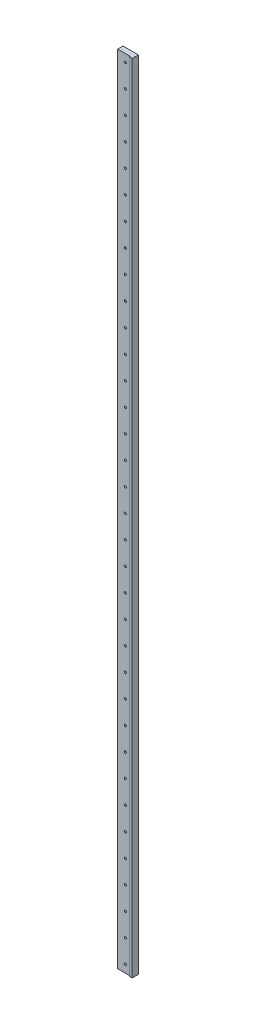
ISO-10303-21;
HEADER;
FILE_DESCRIPTION(('STEP AP214'),'2;1');
FILE_NAME('part.step','',(''),(''),'','','');
FILE_SCHEMA(('AUTOMOTIVE_DESIGN { 1 0 10303 214 1 1 1 1 }'));
ENDSEC;
DATA;
#1=APPLICATION_CONTEXT('core data for automotive mechanical design processes');
#2=APPLICATION_PROTOCOL_DEFINITION('international standard','automotive_design',2000,#1);
#3=PRODUCT_CONTEXT('',#1,'mechanical');
#4=PRODUCT('Part','Part','',(#3));
#5=PRODUCT_RELATED_PRODUCT_CATEGORY('part','',(#4));
#6=PRODUCT_DEFINITION_FORMATION('','',#4);
#7=PRODUCT_DEFINITION_CONTEXT('part definition',#1,'design');
#8=PRODUCT_DEFINITION('design','',#6,#7);
#9=PRODUCT_DEFINITION_SHAPE('','',#8);
#10=(LENGTH_UNIT() NAMED_UNIT(*) SI_UNIT(.MILLI.,.METRE.));
#11=(NAMED_UNIT(*) PLANE_ANGLE_UNIT() SI_UNIT($,.RADIAN.));
#12=(NAMED_UNIT(*) SI_UNIT($,.STERADIAN.) SOLID_ANGLE_UNIT());
#13=UNCERTAINTY_MEASURE_WITH_UNIT(LENGTH_MEASURE(1.E-05),#10,'distance_accuracy_value','');
#14=(GEOMETRIC_REPRESENTATION_CONTEXT(3) GLOBAL_UNCERTAINTY_ASSIGNED_CONTEXT((#13)) GLOBAL_UNIT_ASSIGNED_CONTEXT((#10,
#11,#12)) REPRESENTATION_CONTEXT('',''));
#15=CARTESIAN_POINT('',(0.,0.,0.));
#16=DIRECTION('',(0.,0.,1.));
#17=DIRECTION('',(1.,0.,0.));
#18=AXIS2_PLACEMENT_3D('',#15,#16,#17);
#19=CARTESIAN_POINT('',(549.994351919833,-5200.00115012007,-26.450170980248));
#20=DIRECTION('',(0.,0.,1.));
#21=DIRECTION('',(0.,-1.,0.));
#22=AXIS2_PLACEMENT_3D('',#19,#20,#21);
#23=PLANE('',#22);
#24=DIRECTION('',(-0.999999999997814,2.09112818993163E-06,0.));
#25=VECTOR('',#24,1.);
#26=CARTESIAN_POINT('',(650.005225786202,-0.00135924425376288,-26.4501709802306));
#27=LINE('',#26,#25);
#28=CARTESIAN_POINT('',(550.005225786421,-0.00115013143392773,-26.4501709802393));
#29=VERTEX_POINT('',#28);
#30=CARTESIAN_POINT('',(631.505225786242,-0.00132055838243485,-26.4501709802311));
#31=VERTEX_POINT('',#30);
#32=EDGE_CURVE('E1040',#29,#31,#27,.F.);
#33=ORIENTED_EDGE('',*,*,#32,.F.);
#34=DIRECTION('',(-2.09112818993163E-06,-0.999999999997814,0.));
#35=VECTOR('',#34,1.);
#36=CARTESIAN_POINT('',(549.994351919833,-5200.00115012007,-26.450170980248));
#37=LINE('',#36,#35);
#38=CARTESIAN_POINT('',(549.994351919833,-5200.00115012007,-26.4501709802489));
#39=VERTEX_POINT('',#38);
#40=EDGE_CURVE('E1035',#39,#29,#37,.F.);
#41=ORIENTED_EDGE('',*,*,#40,.F.);
#42=DIRECTION('',(0.999999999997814,-2.09112818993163E-06,0.));
#43=VECTOR('',#42,1.);
#44=CARTESIAN_POINT('',(549.994351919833,-5200.00115012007,-26.4501709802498));
#45=LINE('',#44,#43);
#46=CARTESIAN_POINT('',(631.494351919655,-5200.00132054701,-26.4501709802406));
#47=VERTEX_POINT('',#46);
#48=EDGE_CURVE('E1030',#47,#39,#45,.F.);
#49=ORIENTED_EDGE('',*,*,#48,.F.);
#50=DIRECTION('',(-2.09112818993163E-06,-0.999999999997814,0.));
#51=VECTOR('',#50,1.);
#52=CARTESIAN_POINT('',(631.494351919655,-5200.00132054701,-26.4501709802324));
#53=LINE('',#52,#51);
#54=EDGE_CURVE('E918',#31,#47,#53,.T.);
#55=ORIENTED_EDGE('',*,*,#54,.F.);
#56=EDGE_LOOP('',(#33,#41,#49,#55));
#57=FACE_BOUND('',#56,.T.);
#58=CARTESIAN_POINT('',(600.010139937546,-50.0012547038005,-26.4501709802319));
#59=DIRECTION('',(0.,0.,1.));
#60=DIRECTION('',(1.,0.,0.));
#61=AXIS2_PLACEMENT_3D('',#58,#59,#60);
#62=CIRCLE('',#61,7.);
#63=CARTESIAN_POINT('',(600.010125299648,-57.0012547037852,-26.4501709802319));
#64=VERTEX_POINT('',#63);
#65=CARTESIAN_POINT('',(600.010154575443,-43.0012547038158,-26.4501709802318));
#66=VERTEX_POINT('',#65);
#67=EDGE_CURVE('E705',#64,#66,#62,.F.);
#68=ORIENTED_EDGE('',*,*,#67,.T.);
#69=CARTESIAN_POINT('',(600.010139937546,-50.0012547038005,-26.4501709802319));
#70=DIRECTION('',(0.,0.,1.));
#71=DIRECTION('',(1.,0.,0.));
#72=AXIS2_PLACEMENT_3D('',#69,#70,#71);
#73=CIRCLE('',#72,7.);
#74=EDGE_CURVE('E703',#66,#64,#73,.F.);
#75=ORIENTED_EDGE('',*,*,#74,.T.);
#76=EDGE_LOOP('',(#68,#75));
#77=FACE_BOUND('',#76,.T.);
#78=CARTESIAN_POINT('',(600.009512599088,-200.001254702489,-26.4501709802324));
#79=DIRECTION('',(0.,0.,1.));
#80=DIRECTION('',(1.,0.,0.));
#81=AXIS2_PLACEMENT_3D('',#78,#79,#80);
#82=CIRCLE('',#81,7.);
#83=CARTESIAN_POINT('',(600.00949796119,-207.001254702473,-26.4501709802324));
#84=VERTEX_POINT('',#83);
#85=CARTESIAN_POINT('',(600.009527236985,-193.001254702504,-26.4501709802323));
#86=VERTEX_POINT('',#85);
#87=EDGE_CURVE('E699',#84,#86,#82,.F.);
#88=ORIENTED_EDGE('',*,*,#87,.T.);
#89=CARTESIAN_POINT('',(600.009512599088,-200.001254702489,-26.4501709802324));
#90=DIRECTION('',(0.,0.,1.));
#91=DIRECTION('',(1.,0.,0.));
#92=AXIS2_PLACEMENT_3D('',#89,#90,#91);
#93=CIRCLE('',#92,7.);
#94=EDGE_CURVE('E697',#86,#84,#93,.F.);
#95=ORIENTED_EDGE('',*,*,#94,.T.);
#96=EDGE_LOOP('',(#88,#95));
#97=FACE_BOUND('',#96,.T.);
#98=CARTESIAN_POINT('',(600.008885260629,-350.001254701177,-26.4501709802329));
#99=DIRECTION('',(0.,0.,1.));
#100=DIRECTION('',(1.,0.,0.));
#101=AXIS2_PLACEMENT_3D('',#98,#99,#100);
#102=CIRCLE('',#101,7.);
#103=CARTESIAN_POINT('',(600.008870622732,-357.001254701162,-26.4501709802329));
#104=VERTEX_POINT('',#103);
#105=CARTESIAN_POINT('',(600.008899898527,-343.001254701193,-26.4501709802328));
#106=VERTEX_POINT('',#105);
#107=EDGE_CURVE('E693',#104,#106,#102,.F.);
#108=ORIENTED_EDGE('',*,*,#107,.T.);
#109=CARTESIAN_POINT('',(600.008885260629,-350.001254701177,-26.4501709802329));
#110=DIRECTION('',(0.,0.,1.));
#111=DIRECTION('',(1.,0.,0.));
#112=AXIS2_PLACEMENT_3D('',#109,#110,#111);
#113=CIRCLE('',#112,7.);
#114=EDGE_CURVE('E691',#106,#104,#113,.F.);
#115=ORIENTED_EDGE('',*,*,#114,.T.);
#116=EDGE_LOOP('',(#108,#115));
#117=FACE_BOUND('',#116,.T.);
#118=CARTESIAN_POINT('',(600.008257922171,-500.001254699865,-26.4501709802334));
#119=DIRECTION('',(0.,0.,1.));
#120=DIRECTION('',(1.,0.,0.));
#121=AXIS2_PLACEMENT_3D('',#118,#119,#120);
#122=CIRCLE('',#121,7.);
#123=CARTESIAN_POINT('',(600.008243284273,-507.00125469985,-26.4501709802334));
#124=VERTEX_POINT('',#123);
#125=CARTESIAN_POINT('',(600.008272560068,-493.001254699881,-26.4501709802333));
#126=VERTEX_POINT('',#125);
#127=EDGE_CURVE('E687',#124,#126,#122,.F.);
#128=ORIENTED_EDGE('',*,*,#127,.T.);
#129=CARTESIAN_POINT('',(600.008257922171,-500.001254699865,-26.4501709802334));
#130=DIRECTION('',(0.,0.,1.));
#131=DIRECTION('',(1.,0.,0.));
#132=AXIS2_PLACEMENT_3D('',#129,#130,#131);
#133=CIRCLE('',#132,7.);
#134=EDGE_CURVE('E685',#126,#124,#133,.F.);
#135=ORIENTED_EDGE('',*,*,#134,.T.);
#136=EDGE_LOOP('',(#128,#135));
#137=FACE_BOUND('',#136,.T.);
#138=CARTESIAN_POINT('',(600.007630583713,-650.001254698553,-26.4501709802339));
#139=DIRECTION('',(0.,0.,1.));
#140=DIRECTION('',(1.,0.,0.));
#141=AXIS2_PLACEMENT_3D('',#138,#139,#140);
#142=CIRCLE('',#141,7.);
#143=CARTESIAN_POINT('',(600.007615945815,-657.001254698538,-26.4501709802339));
#144=VERTEX_POINT('',#143);
#145=CARTESIAN_POINT('',(600.00764522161,-643.001254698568,-26.4501709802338));
#146=VERTEX_POINT('',#145);
#147=EDGE_CURVE('E681',#144,#146,#142,.F.);
#148=ORIENTED_EDGE('',*,*,#147,.T.);
#149=CARTESIAN_POINT('',(600.007630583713,-650.001254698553,-26.4501709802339));
#150=DIRECTION('',(0.,0.,1.));
#151=DIRECTION('',(1.,0.,0.));
#152=AXIS2_PLACEMENT_3D('',#149,#150,#151);
#153=CIRCLE('',#152,7.);
#154=EDGE_CURVE('E679',#146,#144,#153,.F.);
#155=ORIENTED_EDGE('',*,*,#154,.T.);
#156=EDGE_LOOP('',(#148,#155));
#157=FACE_BOUND('',#156,.T.);
#158=CARTESIAN_POINT('',(600.007003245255,-800.001254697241,-26.4501709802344));
#159=DIRECTION('',(0.,0.,1.));
#160=DIRECTION('',(1.,0.,0.));
#161=AXIS2_PLACEMENT_3D('',#158,#159,#160);
#162=CIRCLE('',#161,7.);
#163=CARTESIAN_POINT('',(600.006988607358,-807.001254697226,-26.4501709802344));
#164=VERTEX_POINT('',#163);
#165=CARTESIAN_POINT('',(600.007017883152,-793.001254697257,-26.4501709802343));
#166=VERTEX_POINT('',#165);
#167=EDGE_CURVE('E675',#164,#166,#162,.F.);
#168=ORIENTED_EDGE('',*,*,#167,.T.);
#169=CARTESIAN_POINT('',(600.007003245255,-800.001254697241,-26.4501709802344));
#170=DIRECTION('',(0.,0.,1.));
#171=DIRECTION('',(1.,0.,0.));
#172=AXIS2_PLACEMENT_3D('',#169,#170,#171);
#173=CIRCLE('',#172,7.);
#174=EDGE_CURVE('E673',#166,#164,#173,.F.);
#175=ORIENTED_EDGE('',*,*,#174,.T.);
#176=EDGE_LOOP('',(#168,#175));
#177=FACE_BOUND('',#176,.T.);
#178=CARTESIAN_POINT('',(600.006375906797,-950.001254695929,-26.4501709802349));
#179=DIRECTION('',(0.,0.,1.));
#180=DIRECTION('',(1.,0.,0.));
#181=AXIS2_PLACEMENT_3D('',#178,#179,#180);
#182=CIRCLE('',#181,7.);
#183=CARTESIAN_POINT('',(600.0063612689,-957.001254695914,-26.4501709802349));
#184=VERTEX_POINT('',#183);
#185=CARTESIAN_POINT('',(600.006390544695,-943.001254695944,-26.4501709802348));
#186=VERTEX_POINT('',#185);
#187=EDGE_CURVE('E669',#184,#186,#182,.F.);
#188=ORIENTED_EDGE('',*,*,#187,.T.);
#189=CARTESIAN_POINT('',(600.006375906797,-950.001254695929,-26.4501709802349));
#190=DIRECTION('',(0.,0.,1.));
#191=DIRECTION('',(1.,0.,0.));
#192=AXIS2_PLACEMENT_3D('',#189,#190,#191);
#193=CIRCLE('',#192,7.);
#194=EDGE_CURVE('E667',#186,#184,#193,.F.);
#195=ORIENTED_EDGE('',*,*,#194,.T.);
#196=EDGE_LOOP('',(#188,#195));
#197=FACE_BOUND('',#196,.T.);
#198=CARTESIAN_POINT('',(600.005748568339,-1100.00125469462,-26.4501709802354));
#199=DIRECTION('',(0.,0.,1.));
#200=DIRECTION('',(1.,0.,0.));
#201=AXIS2_PLACEMENT_3D('',#198,#199,#200);
#202=CIRCLE('',#201,7.);
#203=CARTESIAN_POINT('',(600.005733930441,-1107.0012546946,-26.4501709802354));
#204=VERTEX_POINT('',#203);
#205=CARTESIAN_POINT('',(600.005763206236,-1093.00125469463,-26.4501709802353));
#206=VERTEX_POINT('',#205);
#207=EDGE_CURVE('E663',#204,#206,#202,.F.);
#208=ORIENTED_EDGE('',*,*,#207,.T.);
#209=CARTESIAN_POINT('',(600.005748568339,-1100.00125469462,-26.4501709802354));
#210=DIRECTION('',(0.,0.,1.));
#211=DIRECTION('',(1.,0.,0.));
#212=AXIS2_PLACEMENT_3D('',#209,#210,#211);
#213=CIRCLE('',#212,7.);
#214=EDGE_CURVE('E661',#206,#204,#213,.F.);
#215=ORIENTED_EDGE('',*,*,#214,.T.);
#216=EDGE_LOOP('',(#208,#215));
#217=FACE_BOUND('',#216,.T.);
#218=CARTESIAN_POINT('',(600.005121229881,-1250.00125469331,-26.4501709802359));
#219=DIRECTION('',(0.,0.,1.));
#220=DIRECTION('',(1.,0.,0.));
#221=AXIS2_PLACEMENT_3D('',#218,#219,#220);
#222=CIRCLE('',#221,7.);
#223=CARTESIAN_POINT('',(600.005106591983,-1257.00125469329,-26.4501709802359));
#224=VERTEX_POINT('',#223);
#225=CARTESIAN_POINT('',(600.005135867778,-1243.00125469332,-26.4501709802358));
#226=VERTEX_POINT('',#225);
#227=EDGE_CURVE('E657',#224,#226,#222,.F.);
#228=ORIENTED_EDGE('',*,*,#227,.T.);
#229=CARTESIAN_POINT('',(600.005121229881,-1250.00125469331,-26.4501709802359));
#230=DIRECTION('',(0.,0.,1.));
#231=DIRECTION('',(1.,0.,0.));
#232=AXIS2_PLACEMENT_3D('',#229,#230,#231);
#233=CIRCLE('',#232,7.);
#234=EDGE_CURVE('E655',#226,#224,#233,.F.);
#235=ORIENTED_EDGE('',*,*,#234,.T.);
#236=EDGE_LOOP('',(#228,#235));
#237=FACE_BOUND('',#236,.T.);
#238=CARTESIAN_POINT('',(600.004493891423,-1400.00125469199,-26.4501709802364));
#239=DIRECTION('',(0.,0.,1.));
#240=DIRECTION('',(1.,0.,0.));
#241=AXIS2_PLACEMENT_3D('',#238,#239,#240);
#242=CIRCLE('',#241,7.);
#243=CARTESIAN_POINT('',(600.004479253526,-1407.00125469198,-26.4501709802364));
#244=VERTEX_POINT('',#243);
#245=CARTESIAN_POINT('',(600.00450852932,-1393.00125469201,-26.4501709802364));
#246=VERTEX_POINT('',#245);
#247=EDGE_CURVE('E651',#244,#246,#242,.F.);
#248=ORIENTED_EDGE('',*,*,#247,.T.);
#249=CARTESIAN_POINT('',(600.004493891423,-1400.00125469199,-26.4501709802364));
#250=DIRECTION('',(0.,0.,1.));
#251=DIRECTION('',(1.,0.,0.));
#252=AXIS2_PLACEMENT_3D('',#249,#250,#251);
#253=CIRCLE('',#252,7.);
#254=EDGE_CURVE('E649',#246,#244,#253,.F.);
#255=ORIENTED_EDGE('',*,*,#254,.T.);
#256=EDGE_LOOP('',(#248,#255));
#257=FACE_BOUND('',#256,.T.);
#258=CARTESIAN_POINT('',(600.003866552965,-1550.00125469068,-26.4501709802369));
#259=DIRECTION('',(0.,0.,1.));
#260=DIRECTION('',(1.,0.,0.));
#261=AXIS2_PLACEMENT_3D('',#258,#259,#260);
#262=CIRCLE('',#261,7.);
#263=CARTESIAN_POINT('',(600.003851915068,-1557.00125469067,-26.4501709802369));
#264=VERTEX_POINT('',#263);
#265=CARTESIAN_POINT('',(600.003881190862,-1543.0012546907,-26.4501709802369));
#266=VERTEX_POINT('',#265);
#267=EDGE_CURVE('E645',#264,#266,#262,.F.);
#268=ORIENTED_EDGE('',*,*,#267,.T.);
#269=CARTESIAN_POINT('',(600.003866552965,-1550.00125469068,-26.4501709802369));
#270=DIRECTION('',(0.,0.,1.));
#271=DIRECTION('',(1.,0.,0.));
#272=AXIS2_PLACEMENT_3D('',#269,#270,#271);
#273=CIRCLE('',#272,7.);
#274=EDGE_CURVE('E643',#266,#264,#273,.F.);
#275=ORIENTED_EDGE('',*,*,#274,.T.);
#276=EDGE_LOOP('',(#268,#275));
#277=FACE_BOUND('',#276,.T.);
#278=CARTESIAN_POINT('',(600.003239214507,-1700.00125468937,-26.4501709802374));
#279=DIRECTION('',(0.,0.,1.));
#280=DIRECTION('',(1.,0.,0.));
#281=AXIS2_PLACEMENT_3D('',#278,#279,#280);
#282=CIRCLE('',#281,7.);
#283=CARTESIAN_POINT('',(600.003224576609,-1707.00125468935,-26.4501709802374));
#284=VERTEX_POINT('',#283);
#285=CARTESIAN_POINT('',(600.003253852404,-1693.00125468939,-26.4501709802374));
#286=VERTEX_POINT('',#285);
#287=EDGE_CURVE('E639',#284,#286,#282,.F.);
#288=ORIENTED_EDGE('',*,*,#287,.T.);
#289=CARTESIAN_POINT('',(600.003239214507,-1700.00125468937,-26.4501709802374));
#290=DIRECTION('',(0.,0.,1.));
#291=DIRECTION('',(1.,0.,0.));
#292=AXIS2_PLACEMENT_3D('',#289,#290,#291);
#293=CIRCLE('',#292,7.);
#294=EDGE_CURVE('E637',#286,#284,#293,.F.);
#295=ORIENTED_EDGE('',*,*,#294,.T.);
#296=EDGE_LOOP('',(#288,#295));
#297=FACE_BOUND('',#296,.T.);
#298=CARTESIAN_POINT('',(600.002611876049,-1850.00125468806,-26.4501709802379));
#299=DIRECTION('',(0.,0.,1.));
#300=DIRECTION('',(1.,0.,0.));
#301=AXIS2_PLACEMENT_3D('',#298,#299,#300);
#302=CIRCLE('',#301,7.);
#303=CARTESIAN_POINT('',(600.002597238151,-1857.00125468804,-26.4501709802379));
#304=VERTEX_POINT('',#303);
#305=CARTESIAN_POINT('',(600.002626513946,-1843.00125468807,-26.4501709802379));
#306=VERTEX_POINT('',#305);
#307=EDGE_CURVE('E633',#304,#306,#302,.F.);
#308=ORIENTED_EDGE('',*,*,#307,.T.);
#309=CARTESIAN_POINT('',(600.002611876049,-1850.00125468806,-26.4501709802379));
#310=DIRECTION('',(0.,0.,1.));
#311=DIRECTION('',(1.,0.,0.));
#312=AXIS2_PLACEMENT_3D('',#309,#310,#311);
#313=CIRCLE('',#312,7.);
#314=EDGE_CURVE('E631',#306,#304,#313,.F.);
#315=ORIENTED_EDGE('',*,*,#314,.T.);
#316=EDGE_LOOP('',(#308,#315));
#317=FACE_BOUND('',#316,.T.);
#318=CARTESIAN_POINT('',(600.001984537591,-2000.00125468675,-26.4501709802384));
#319=DIRECTION('',(0.,0.,1.));
#320=DIRECTION('',(1.,0.,0.));
#321=AXIS2_PLACEMENT_3D('',#318,#319,#320);
#322=CIRCLE('',#321,7.);
#323=CARTESIAN_POINT('',(600.001969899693,-2007.00125468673,-26.4501709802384));
#324=VERTEX_POINT('',#323);
#325=CARTESIAN_POINT('',(600.001999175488,-1993.00125468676,-26.4501709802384));
#326=VERTEX_POINT('',#325);
#327=EDGE_CURVE('E627',#324,#326,#322,.F.);
#328=ORIENTED_EDGE('',*,*,#327,.T.);
#329=CARTESIAN_POINT('',(600.001984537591,-2000.00125468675,-26.4501709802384));
#330=DIRECTION('',(0.,0.,1.));
#331=DIRECTION('',(1.,0.,0.));
#332=AXIS2_PLACEMENT_3D('',#329,#330,#331);
#333=CIRCLE('',#332,7.);
#334=EDGE_CURVE('E625',#326,#324,#333,.F.);
#335=ORIENTED_EDGE('',*,*,#334,.T.);
#336=EDGE_LOOP('',(#328,#335));
#337=FACE_BOUND('',#336,.T.);
#338=CARTESIAN_POINT('',(600.001357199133,-2150.00125468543,-26.4501709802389));
#339=DIRECTION('',(0.,0.,1.));
#340=DIRECTION('',(1.,0.,0.));
#341=AXIS2_PLACEMENT_3D('',#338,#339,#340);
#342=CIRCLE('',#341,7.);
#343=CARTESIAN_POINT('',(600.001342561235,-2157.00125468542,-26.4501709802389));
#344=VERTEX_POINT('',#343);
#345=CARTESIAN_POINT('',(600.00137183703,-2143.00125468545,-26.4501709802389));
#346=VERTEX_POINT('',#345);
#347=EDGE_CURVE('E621',#344,#346,#342,.F.);
#348=ORIENTED_EDGE('',*,*,#347,.T.);
#349=CARTESIAN_POINT('',(600.001357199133,-2150.00125468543,-26.4501709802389));
#350=DIRECTION('',(0.,0.,1.));
#351=DIRECTION('',(1.,0.,0.));
#352=AXIS2_PLACEMENT_3D('',#349,#350,#351);
#353=CIRCLE('',#352,7.);
#354=EDGE_CURVE('E619',#346,#344,#353,.F.);
#355=ORIENTED_EDGE('',*,*,#354,.T.);
#356=EDGE_LOOP('',(#348,#355));
#357=FACE_BOUND('',#356,.T.);
#358=CARTESIAN_POINT('',(600.000729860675,-2300.00125468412,-26.4501709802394));
#359=DIRECTION('',(0.,0.,1.));
#360=DIRECTION('',(1.,0.,0.));
#361=AXIS2_PLACEMENT_3D('',#358,#359,#360);
#362=CIRCLE('',#361,7.);
#363=CARTESIAN_POINT('',(600.000715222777,-2307.00125468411,-26.4501709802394));
#364=VERTEX_POINT('',#363);
#365=CARTESIAN_POINT('',(600.000744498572,-2293.00125468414,-26.4501709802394));
#366=VERTEX_POINT('',#365);
#367=EDGE_CURVE('E615',#364,#366,#362,.F.);
#368=ORIENTED_EDGE('',*,*,#367,.T.);
#369=CARTESIAN_POINT('',(600.000729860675,-2300.00125468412,-26.4501709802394));
#370=DIRECTION('',(0.,0.,1.));
#371=DIRECTION('',(1.,0.,0.));
#372=AXIS2_PLACEMENT_3D('',#369,#370,#371);
#373=CIRCLE('',#372,7.);
#374=EDGE_CURVE('E613',#366,#364,#373,.F.);
#375=ORIENTED_EDGE('',*,*,#374,.T.);
#376=EDGE_LOOP('',(#368,#375));
#377=FACE_BOUND('',#376,.T.);
#378=CARTESIAN_POINT('',(600.000102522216,-2450.00125468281,-26.4501709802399));
#379=DIRECTION('',(0.,0.,1.));
#380=DIRECTION('',(1.,0.,0.));
#381=AXIS2_PLACEMENT_3D('',#378,#379,#380);
#382=CIRCLE('',#381,7.);
#383=CARTESIAN_POINT('',(600.000087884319,-2457.0012546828,-26.4501709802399));
#384=VERTEX_POINT('',#383);
#385=CARTESIAN_POINT('',(600.000117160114,-2443.00125468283,-26.4501709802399));
#386=VERTEX_POINT('',#385);
#387=EDGE_CURVE('E609',#384,#386,#382,.F.);
#388=ORIENTED_EDGE('',*,*,#387,.T.);
#389=CARTESIAN_POINT('',(600.000102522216,-2450.00125468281,-26.4501709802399));
#390=DIRECTION('',(0.,0.,1.));
#391=DIRECTION('',(1.,0.,0.));
#392=AXIS2_PLACEMENT_3D('',#389,#390,#391);
#393=CIRCLE('',#392,7.);
#394=EDGE_CURVE('E607',#386,#384,#393,.F.);
#395=ORIENTED_EDGE('',*,*,#394,.T.);
#396=EDGE_LOOP('',(#388,#395));
#397=FACE_BOUND('',#396,.T.);
#398=CARTESIAN_POINT('',(599.999475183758,-2600.0012546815,-26.4501709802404));
#399=DIRECTION('',(0.,0.,1.));
#400=DIRECTION('',(1.,0.,0.));
#401=AXIS2_PLACEMENT_3D('',#398,#399,#400);
#402=CIRCLE('',#401,7.);
#403=CARTESIAN_POINT('',(599.999460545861,-2607.00125468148,-26.4501709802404));
#404=VERTEX_POINT('',#403);
#405=CARTESIAN_POINT('',(599.999489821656,-2593.00125468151,-26.4501709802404));
#406=VERTEX_POINT('',#405);
#407=EDGE_CURVE('E603',#404,#406,#402,.F.);
#408=ORIENTED_EDGE('',*,*,#407,.T.);
#409=CARTESIAN_POINT('',(599.999475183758,-2600.0012546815,-26.4501709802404));
#410=DIRECTION('',(0.,0.,1.));
#411=DIRECTION('',(1.,0.,0.));
#412=AXIS2_PLACEMENT_3D('',#409,#410,#411);
#413=CIRCLE('',#412,7.);
#414=EDGE_CURVE('E601',#406,#404,#413,.F.);
#415=ORIENTED_EDGE('',*,*,#414,.T.);
#416=EDGE_LOOP('',(#408,#415));
#417=FACE_BOUND('',#416,.T.);
#418=CARTESIAN_POINT('',(599.9988478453,-2750.00125468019,-26.4501709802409));
#419=DIRECTION('',(0.,0.,1.));
#420=DIRECTION('',(1.,0.,0.));
#421=AXIS2_PLACEMENT_3D('',#418,#419,#420);
#422=CIRCLE('',#421,7.);
#423=CARTESIAN_POINT('',(599.998833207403,-2757.00125468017,-26.4501709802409));
#424=VERTEX_POINT('',#423);
#425=CARTESIAN_POINT('',(599.998862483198,-2743.0012546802,-26.4501709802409));
#426=VERTEX_POINT('',#425);
#427=EDGE_CURVE('E597',#424,#426,#422,.F.);
#428=ORIENTED_EDGE('',*,*,#427,.T.);
#429=CARTESIAN_POINT('',(599.9988478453,-2750.00125468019,-26.4501709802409));
#430=DIRECTION('',(0.,0.,1.));
#431=DIRECTION('',(1.,0.,0.));
#432=AXIS2_PLACEMENT_3D('',#429,#430,#431);
#433=CIRCLE('',#432,7.);
#434=EDGE_CURVE('E595',#426,#424,#433,.F.);
#435=ORIENTED_EDGE('',*,*,#434,.T.);
#436=EDGE_LOOP('',(#428,#435));
#437=FACE_BOUND('',#436,.T.);
#438=CARTESIAN_POINT('',(599.998220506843,-2900.00125467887,-26.4501709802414));
#439=DIRECTION('',(0.,0.,1.));
#440=DIRECTION('',(1.,0.,0.));
#441=AXIS2_PLACEMENT_3D('',#438,#439,#440);
#442=CIRCLE('',#441,7.);
#443=CARTESIAN_POINT('',(599.998205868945,-2907.00125467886,-26.4501709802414));
#444=VERTEX_POINT('',#443);
#445=CARTESIAN_POINT('',(599.99823514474,-2893.00125467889,-26.4501709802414));
#446=VERTEX_POINT('',#445);
#447=EDGE_CURVE('E591',#444,#446,#442,.F.);
#448=ORIENTED_EDGE('',*,*,#447,.T.);
#449=CARTESIAN_POINT('',(599.998220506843,-2900.00125467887,-26.4501709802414));
#450=DIRECTION('',(0.,0.,1.));
#451=DIRECTION('',(1.,0.,0.));
#452=AXIS2_PLACEMENT_3D('',#449,#450,#451);
#453=CIRCLE('',#452,7.);
#454=EDGE_CURVE('E589',#446,#444,#453,.F.);
#455=ORIENTED_EDGE('',*,*,#454,.T.);
#456=EDGE_LOOP('',(#448,#455));
#457=FACE_BOUND('',#456,.T.);
#458=CARTESIAN_POINT('',(599.997593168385,-3050.00125467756,-26.4501709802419));
#459=DIRECTION('',(0.,0.,1.));
#460=DIRECTION('',(1.,0.,0.));
#461=AXIS2_PLACEMENT_3D('',#458,#459,#460);
#462=CIRCLE('',#461,7.);
#463=CARTESIAN_POINT('',(599.997578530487,-3057.00125467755,-26.4501709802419));
#464=VERTEX_POINT('',#463);
#465=CARTESIAN_POINT('',(599.997607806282,-3043.00125467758,-26.4501709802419));
#466=VERTEX_POINT('',#465);
#467=EDGE_CURVE('E585',#464,#466,#462,.F.);
#468=ORIENTED_EDGE('',*,*,#467,.T.);
#469=CARTESIAN_POINT('',(599.997593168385,-3050.00125467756,-26.4501709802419));
#470=DIRECTION('',(0.,0.,1.));
#471=DIRECTION('',(1.,0.,0.));
#472=AXIS2_PLACEMENT_3D('',#469,#470,#471);
#473=CIRCLE('',#472,7.);
#474=EDGE_CURVE('E583',#466,#464,#473,.F.);
#475=ORIENTED_EDGE('',*,*,#474,.T.);
#476=EDGE_LOOP('',(#468,#475));
#477=FACE_BOUND('',#476,.T.);
#478=CARTESIAN_POINT('',(599.996965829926,-3200.00125467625,-26.4501709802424));
#479=DIRECTION('',(0.,0.,1.));
#480=DIRECTION('',(1.,0.,0.));
#481=AXIS2_PLACEMENT_3D('',#478,#479,#480);
#482=CIRCLE('',#481,7.);
#483=CARTESIAN_POINT('',(599.996951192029,-3207.00125467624,-26.4501709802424));
#484=VERTEX_POINT('',#483);
#485=CARTESIAN_POINT('',(599.996980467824,-3193.00125467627,-26.4501709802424));
#486=VERTEX_POINT('',#485);
#487=EDGE_CURVE('E579',#484,#486,#482,.F.);
#488=ORIENTED_EDGE('',*,*,#487,.T.);
#489=CARTESIAN_POINT('',(599.996965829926,-3200.00125467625,-26.4501709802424));
#490=DIRECTION('',(0.,0.,1.));
#491=DIRECTION('',(1.,0.,0.));
#492=AXIS2_PLACEMENT_3D('',#489,#490,#491);
#493=CIRCLE('',#492,7.);
#494=EDGE_CURVE('E577',#486,#484,#493,.F.);
#495=ORIENTED_EDGE('',*,*,#494,.T.);
#496=EDGE_LOOP('',(#488,#495));
#497=FACE_BOUND('',#496,.T.);
#498=CARTESIAN_POINT('',(599.996338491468,-3350.00125467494,-26.4501709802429));
#499=DIRECTION('',(0.,0.,1.));
#500=DIRECTION('',(1.,0.,0.));
#501=AXIS2_PLACEMENT_3D('',#498,#499,#500);
#502=CIRCLE('',#501,7.);
#503=CARTESIAN_POINT('',(599.996323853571,-3357.00125467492,-26.4501709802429));
#504=VERTEX_POINT('',#503);
#505=CARTESIAN_POINT('',(599.996353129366,-3343.00125467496,-26.4501709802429));
#506=VERTEX_POINT('',#505);
#507=EDGE_CURVE('E573',#504,#506,#502,.F.);
#508=ORIENTED_EDGE('',*,*,#507,.T.);
#509=CARTESIAN_POINT('',(599.996338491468,-3350.00125467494,-26.4501709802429));
#510=DIRECTION('',(0.,0.,1.));
#511=DIRECTION('',(1.,0.,0.));
#512=AXIS2_PLACEMENT_3D('',#509,#510,#511);
#513=CIRCLE('',#512,7.);
#514=EDGE_CURVE('E571',#506,#504,#513,.F.);
#515=ORIENTED_EDGE('',*,*,#514,.T.);
#516=EDGE_LOOP('',(#508,#515));
#517=FACE_BOUND('',#516,.T.);
#518=CARTESIAN_POINT('',(599.99571115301,-3500.00125467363,-26.4501709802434));
#519=DIRECTION('',(0.,0.,1.));
#520=DIRECTION('',(1.,0.,0.));
#521=AXIS2_PLACEMENT_3D('',#518,#519,#520);
#522=CIRCLE('',#521,7.);
#523=CARTESIAN_POINT('',(599.995696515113,-3507.00125467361,-26.4501709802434));
#524=VERTEX_POINT('',#523);
#525=CARTESIAN_POINT('',(599.995725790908,-3493.00125467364,-26.4501709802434));
#526=VERTEX_POINT('',#525);
#527=EDGE_CURVE('E567',#524,#526,#522,.F.);
#528=ORIENTED_EDGE('',*,*,#527,.T.);
#529=CARTESIAN_POINT('',(599.99571115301,-3500.00125467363,-26.4501709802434));
#530=DIRECTION('',(0.,0.,1.));
#531=DIRECTION('',(1.,0.,0.));
#532=AXIS2_PLACEMENT_3D('',#529,#530,#531);
#533=CIRCLE('',#532,7.);
#534=EDGE_CURVE('E565',#526,#524,#533,.F.);
#535=ORIENTED_EDGE('',*,*,#534,.T.);
#536=EDGE_LOOP('',(#528,#535));
#537=FACE_BOUND('',#536,.T.);
#538=CARTESIAN_POINT('',(599.995083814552,-3650.00125467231,-26.4501709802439));
#539=DIRECTION('',(0.,0.,1.));
#540=DIRECTION('',(1.,0.,0.));
#541=AXIS2_PLACEMENT_3D('',#538,#539,#540);
#542=CIRCLE('',#541,7.);
#543=CARTESIAN_POINT('',(599.995069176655,-3657.0012546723,-26.4501709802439));
#544=VERTEX_POINT('',#543);
#545=CARTESIAN_POINT('',(599.99509845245,-3643.00125467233,-26.4501709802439));
#546=VERTEX_POINT('',#545);
#547=EDGE_CURVE('E561',#544,#546,#542,.F.);
#548=ORIENTED_EDGE('',*,*,#547,.T.);
#549=CARTESIAN_POINT('',(599.995083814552,-3650.00125467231,-26.4501709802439));
#550=DIRECTION('',(0.,0.,1.));
#551=DIRECTION('',(1.,0.,0.));
#552=AXIS2_PLACEMENT_3D('',#549,#550,#551);
#553=CIRCLE('',#552,7.);
#554=EDGE_CURVE('E559',#546,#544,#553,.F.);
#555=ORIENTED_EDGE('',*,*,#554,.T.);
#556=EDGE_LOOP('',(#548,#555));
#557=FACE_BOUND('',#556,.T.);
#558=CARTESIAN_POINT('',(599.994456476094,-3800.001254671,-26.4501709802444));
#559=DIRECTION('',(0.,0.,1.));
#560=DIRECTION('',(1.,0.,0.));
#561=AXIS2_PLACEMENT_3D('',#558,#559,#560);
#562=CIRCLE('',#561,7.);
#563=CARTESIAN_POINT('',(599.994441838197,-3807.00125467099,-26.4501709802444));
#564=VERTEX_POINT('',#563);
#565=CARTESIAN_POINT('',(599.994471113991,-3793.00125467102,-26.4501709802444));
#566=VERTEX_POINT('',#565);
#567=EDGE_CURVE('E555',#564,#566,#562,.F.);
#568=ORIENTED_EDGE('',*,*,#567,.T.);
#569=CARTESIAN_POINT('',(599.994456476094,-3800.001254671,-26.4501709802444));
#570=DIRECTION('',(0.,0.,1.));
#571=DIRECTION('',(1.,0.,0.));
#572=AXIS2_PLACEMENT_3D('',#569,#570,#571);
#573=CIRCLE('',#572,7.);
#574=EDGE_CURVE('E553',#566,#564,#573,.F.);
#575=ORIENTED_EDGE('',*,*,#574,.T.);
#576=EDGE_LOOP('',(#568,#575));
#577=FACE_BOUND('',#576,.T.);
#578=CARTESIAN_POINT('',(599.993829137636,-3950.00125466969,-26.4501709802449));
#579=DIRECTION('',(0.,0.,1.));
#580=DIRECTION('',(1.,0.,0.));
#581=AXIS2_PLACEMENT_3D('',#578,#579,#580);
#582=CIRCLE('',#581,7.);
#583=CARTESIAN_POINT('',(599.993814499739,-3957.00125466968,-26.4501709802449));
#584=VERTEX_POINT('',#583);
#585=CARTESIAN_POINT('',(599.993843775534,-3943.00125466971,-26.4501709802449));
#586=VERTEX_POINT('',#585);
#587=EDGE_CURVE('E549',#584,#586,#582,.F.);
#588=ORIENTED_EDGE('',*,*,#587,.T.);
#589=CARTESIAN_POINT('',(599.993829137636,-3950.00125466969,-26.4501709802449));
#590=DIRECTION('',(0.,0.,1.));
#591=DIRECTION('',(1.,0.,0.));
#592=AXIS2_PLACEMENT_3D('',#589,#590,#591);
#593=CIRCLE('',#592,7.);
#594=EDGE_CURVE('E547',#586,#584,#593,.F.);
#595=ORIENTED_EDGE('',*,*,#594,.T.);
#596=EDGE_LOOP('',(#588,#595));
#597=FACE_BOUND('',#596,.T.);
#598=CARTESIAN_POINT('',(599.993201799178,-4100.00125466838,-26.4501709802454));
#599=DIRECTION('',(0.,0.,1.));
#600=DIRECTION('',(1.,0.,0.));
#601=AXIS2_PLACEMENT_3D('',#598,#599,#600);
#602=CIRCLE('',#601,7.);
#603=CARTESIAN_POINT('',(599.993187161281,-4107.00125466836,-26.4501709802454));
#604=VERTEX_POINT('',#603);
#605=CARTESIAN_POINT('',(599.993216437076,-4093.0012546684,-26.4501709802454));
#606=VERTEX_POINT('',#605);
#607=EDGE_CURVE('E543',#604,#606,#602,.F.);
#608=ORIENTED_EDGE('',*,*,#607,.T.);
#609=CARTESIAN_POINT('',(599.993201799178,-4100.00125466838,-26.4501709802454));
#610=DIRECTION('',(0.,0.,1.));
#611=DIRECTION('',(1.,0.,0.));
#612=AXIS2_PLACEMENT_3D('',#609,#610,#611);
#613=CIRCLE('',#612,7.);
#614=EDGE_CURVE('E541',#606,#604,#613,.F.);
#615=ORIENTED_EDGE('',*,*,#614,.T.);
#616=EDGE_LOOP('',(#608,#615));
#617=FACE_BOUND('',#616,.T.);
#618=CARTESIAN_POINT('',(599.99257446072,-4250.00125466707,-26.4501709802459));
#619=DIRECTION('',(0.,0.,1.));
#620=DIRECTION('',(1.,0.,0.));
#621=AXIS2_PLACEMENT_3D('',#618,#619,#620);
#622=CIRCLE('',#621,7.);
#623=CARTESIAN_POINT('',(599.992559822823,-4257.00125466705,-26.4501709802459));
#624=VERTEX_POINT('',#623);
#625=CARTESIAN_POINT('',(599.992589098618,-4243.00125466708,-26.4501709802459));
#626=VERTEX_POINT('',#625);
#627=EDGE_CURVE('E537',#624,#626,#622,.F.);
#628=ORIENTED_EDGE('',*,*,#627,.T.);
#629=CARTESIAN_POINT('',(599.99257446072,-4250.00125466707,-26.4501709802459));
#630=DIRECTION('',(0.,0.,1.));
#631=DIRECTION('',(1.,0.,0.));
#632=AXIS2_PLACEMENT_3D('',#629,#630,#631);
#633=CIRCLE('',#632,7.);
#634=EDGE_CURVE('E535',#626,#624,#633,.F.);
#635=ORIENTED_EDGE('',*,*,#634,.T.);
#636=EDGE_LOOP('',(#628,#635));
#637=FACE_BOUND('',#636,.T.);
#638=CARTESIAN_POINT('',(599.991947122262,-4400.00125466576,-26.4501709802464));
#639=DIRECTION('',(0.,0.,1.));
#640=DIRECTION('',(1.,0.,0.));
#641=AXIS2_PLACEMENT_3D('',#638,#639,#640);
#642=CIRCLE('',#641,7.);
#643=CARTESIAN_POINT('',(599.991932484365,-4407.00125466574,-26.4501709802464));
#644=VERTEX_POINT('',#643);
#645=CARTESIAN_POINT('',(599.991961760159,-4393.00125466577,-26.4501709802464));
#646=VERTEX_POINT('',#645);
#647=EDGE_CURVE('E531',#644,#646,#642,.F.);
#648=ORIENTED_EDGE('',*,*,#647,.T.);
#649=CARTESIAN_POINT('',(599.991947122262,-4400.00125466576,-26.4501709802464));
#650=DIRECTION('',(0.,0.,1.));
#651=DIRECTION('',(1.,0.,0.));
#652=AXIS2_PLACEMENT_3D('',#649,#650,#651);
#653=CIRCLE('',#652,7.);
#654=EDGE_CURVE('E529',#646,#644,#653,.F.);
#655=ORIENTED_EDGE('',*,*,#654,.T.);
#656=EDGE_LOOP('',(#648,#655));
#657=FACE_BOUND('',#656,.T.);
#658=CARTESIAN_POINT('',(599.991319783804,-4550.00125466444,-26.4501709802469));
#659=DIRECTION('',(0.,0.,1.));
#660=DIRECTION('',(1.,0.,0.));
#661=AXIS2_PLACEMENT_3D('',#658,#659,#660);
#662=CIRCLE('',#661,7.);
#663=CARTESIAN_POINT('',(599.991305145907,-4557.00125466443,-26.4501709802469));
#664=VERTEX_POINT('',#663);
#665=CARTESIAN_POINT('',(599.991334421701,-4543.00125466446,-26.4501709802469));
#666=VERTEX_POINT('',#665);
#667=EDGE_CURVE('E525',#664,#666,#662,.F.);
#668=ORIENTED_EDGE('',*,*,#667,.T.);
#669=CARTESIAN_POINT('',(599.991319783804,-4550.00125466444,-26.4501709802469));
#670=DIRECTION('',(0.,0.,1.));
#671=DIRECTION('',(1.,0.,0.));
#672=AXIS2_PLACEMENT_3D('',#669,#670,#671);
#673=CIRCLE('',#672,7.);
#674=EDGE_CURVE('E523',#666,#664,#673,.F.);
#675=ORIENTED_EDGE('',*,*,#674,.T.);
#676=EDGE_LOOP('',(#668,#675));
#677=FACE_BOUND('',#676,.T.);
#678=CARTESIAN_POINT('',(599.990692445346,-4700.00125466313,-26.4501709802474));
#679=DIRECTION('',(0.,0.,1.));
#680=DIRECTION('',(1.,0.,0.));
#681=AXIS2_PLACEMENT_3D('',#678,#679,#680);
#682=CIRCLE('',#681,7.);
#683=CARTESIAN_POINT('',(599.990677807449,-4707.00125466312,-26.4501709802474));
#684=VERTEX_POINT('',#683);
#685=CARTESIAN_POINT('',(599.990707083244,-4693.00125466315,-26.4501709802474));
#686=VERTEX_POINT('',#685);
#687=EDGE_CURVE('E519',#684,#686,#682,.F.);
#688=ORIENTED_EDGE('',*,*,#687,.T.);
#689=CARTESIAN_POINT('',(599.990692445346,-4700.00125466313,-26.4501709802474));
#690=DIRECTION('',(0.,0.,1.));
#691=DIRECTION('',(1.,0.,0.));
#692=AXIS2_PLACEMENT_3D('',#689,#690,#691);
#693=CIRCLE('',#692,7.);
#694=EDGE_CURVE('E517',#686,#684,#693,.F.);
#695=ORIENTED_EDGE('',*,*,#694,.T.);
#696=EDGE_LOOP('',(#688,#695));
#697=FACE_BOUND('',#696,.T.);
#698=CARTESIAN_POINT('',(599.990065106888,-4850.00125466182,-26.4501709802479));
#699=DIRECTION('',(0.,0.,1.));
#700=DIRECTION('',(1.,0.,0.));
#701=AXIS2_PLACEMENT_3D('',#698,#699,#700);
#702=CIRCLE('',#701,7.);
#703=CARTESIAN_POINT('',(599.990050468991,-4857.0012546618,-26.4501709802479));
#704=VERTEX_POINT('',#703);
#705=CARTESIAN_POINT('',(599.990079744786,-4843.00125466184,-26.4501709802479));
#706=VERTEX_POINT('',#705);
#707=EDGE_CURVE('E513',#704,#706,#702,.F.);
#708=ORIENTED_EDGE('',*,*,#707,.T.);
#709=CARTESIAN_POINT('',(599.990065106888,-4850.00125466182,-26.4501709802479));
#710=DIRECTION('',(0.,0.,1.));
#711=DIRECTION('',(1.,0.,0.));
#712=AXIS2_PLACEMENT_3D('',#709,#710,#711);
#713=CIRCLE('',#712,7.);
#714=EDGE_CURVE('E511',#706,#704,#713,.F.);
#715=ORIENTED_EDGE('',*,*,#714,.T.);
#716=EDGE_LOOP('',(#708,#715));
#717=FACE_BOUND('',#716,.T.);
#718=CARTESIAN_POINT('',(599.98943776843,-5000.00125466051,-26.4501709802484));
#719=DIRECTION('',(0.,0.,1.));
#720=DIRECTION('',(1.,0.,0.));
#721=AXIS2_PLACEMENT_3D('',#718,#719,#720);
#722=CIRCLE('',#721,7.);
#723=CARTESIAN_POINT('',(599.989423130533,-5007.00125466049,-26.4501709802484));
#724=VERTEX_POINT('',#723);
#725=CARTESIAN_POINT('',(599.989452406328,-4993.00125466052,-26.4501709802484));
#726=VERTEX_POINT('',#725);
#727=EDGE_CURVE('E508',#724,#726,#722,.F.);
#728=ORIENTED_EDGE('',*,*,#727,.T.);
#729=CARTESIAN_POINT('',(599.98943776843,-5000.00125466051,-26.4501709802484));
#730=DIRECTION('',(0.,0.,1.));
#731=DIRECTION('',(1.,0.,0.));
#732=AXIS2_PLACEMENT_3D('',#729,#730,#731);
#733=CIRCLE('',#732,7.);
#734=EDGE_CURVE('E501',#726,#724,#733,.F.);
#735=ORIENTED_EDGE('',*,*,#734,.T.);
#736=EDGE_LOOP('',(#728,#735));
#737=FACE_BOUND('',#736,.T.);
#738=CARTESIAN_POINT('',(599.988810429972,-5150.0012546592,-26.4501709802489));
#739=DIRECTION('',(0.,0.,1.));
#740=DIRECTION('',(1.,0.,0.));
#741=AXIS2_PLACEMENT_3D('',#738,#739,#740);
#742=CIRCLE('',#741,7.);
#743=CARTESIAN_POINT('',(599.988795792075,-5157.00125465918,-26.4501709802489));
#744=VERTEX_POINT('',#743);
#745=CARTESIAN_POINT('',(599.98882506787,-5143.00125465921,-26.4501709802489));
#746=VERTEX_POINT('',#745);
#747=EDGE_CURVE('E487',#744,#746,#742,.F.);
#748=ORIENTED_EDGE('',*,*,#747,.T.);
#749=CARTESIAN_POINT('',(599.988810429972,-5150.0012546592,-26.4501709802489));
#750=DIRECTION('',(0.,0.,1.));
#751=DIRECTION('',(1.,0.,0.));
#752=AXIS2_PLACEMENT_3D('',#749,#750,#751);
#753=CIRCLE('',#752,7.);
#754=EDGE_CURVE('E20',#746,#744,#753,.F.);
#755=ORIENTED_EDGE('',*,*,#754,.T.);
#756=EDGE_LOOP('',(#748,#755));
#757=FACE_BOUND('',#756,.T.);
#758=ADVANCED_FACE('F17',(#57,#77,#97,#117,#137,#157,#177,#197,#217,#237,#257,#277,#297,#317,
#337,#357,#377,#397,#417,#437,#457,#477,#497,#517,#537,#557,#577,#597,#617,#637,#657,#677,#697,
#717,#737,#757),#23,.T.);
#759=CARTESIAN_POINT('',(631.494351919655,-5200.00132054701,-26.4501709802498));
#760=DIRECTION('',(-0.999999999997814,2.09112818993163E-06,0.));
#761=DIRECTION('',(-2.09112818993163E-06,-0.999999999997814,0.));
#762=AXIS2_PLACEMENT_3D('',#759,#760,#761);
#763=PLANE('',#762);
#764=DIRECTION('',(0.,0.,1.));
#765=VECTOR('',#764,1.);
#766=CARTESIAN_POINT('',(631.505225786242,-0.00132055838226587,-21.4501709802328));
#767=LINE('',#766,#765);
#768=CARTESIAN_POINT('',(631.505225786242,-0.00132055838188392,-21.4501709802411));
#769=VERTEX_POINT('',#768);
#770=EDGE_CURVE('E1043',#31,#769,#767,.T.);
#771=ORIENTED_EDGE('',*,*,#770,.F.);
#772=ORIENTED_EDGE('',*,*,#54,.T.);
#773=DIRECTION('',(0.,0.,1.));
#774=VECTOR('',#773,1.);
#775=CARTESIAN_POINT('',(631.494351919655,-5200.00132054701,-61.4501709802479));
#776=LINE('',#775,#774);
#777=CARTESIAN_POINT('',(631.494351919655,-5200.00132054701,-21.4501709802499));
#778=VERTEX_POINT('',#777);
#779=EDGE_CURVE('E1027',#778,#47,#776,.F.);
#780=ORIENTED_EDGE('',*,*,#779,.F.);
#781=DIRECTION('',(-2.09112818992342E-06,-0.999999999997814,0.));
#782=VECTOR('',#781,1.);
#783=CARTESIAN_POINT('',(631.505225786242,-0.00132055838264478,-21.4501709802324));
#784=LINE('',#783,#782);
#785=EDGE_CURVE('E492',#769,#778,#784,.T.);
#786=ORIENTED_EDGE('',*,*,#785,.F.);
#787=EDGE_LOOP('',(#771,#772,#780,#786));
#788=FACE_BOUND('',#787,.T.);
#789=ADVANCED_FACE('F1075',(#788),#763,.T.);
#790=CARTESIAN_POINT('',(631.494351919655,-5200.00132054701,-21.4501709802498));
#791=DIRECTION('',(0.,0.,1.));
#792=DIRECTION('',(0.,-1.,0.));
#793=AXIS2_PLACEMENT_3D('',#790,#791,#792);
#794=PLANE('',#793);
#795=DIRECTION('',(-0.999999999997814,2.09112818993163E-06,0.));
#796=VECTOR('',#795,1.);
#797=CARTESIAN_POINT('',(650.005225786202,-0.0013592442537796,-21.4501709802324));
#798=LINE('',#797,#796);
#799=CARTESIAN_POINT('',(650.005225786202,-0.00135924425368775,-21.4501709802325));
#800=VERTEX_POINT('',#799);
#801=EDGE_CURVE('E1046',#769,#800,#798,.F.);
#802=ORIENTED_EDGE('',*,*,#801,.F.);
#803=ORIENTED_EDGE('',*,*,#785,.T.);
#804=DIRECTION('',(0.999999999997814,-2.09112818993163E-06,0.));
#805=VECTOR('',#804,1.);
#806=CARTESIAN_POINT('',(549.994351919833,-5200.00115012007,-21.4501709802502));
#807=LINE('',#806,#805);
#808=CARTESIAN_POINT('',(649.994351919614,-5200.00135923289,-21.4501709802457));
#809=VERTEX_POINT('',#808);
#810=EDGE_CURVE('E1023',#809,#778,#807,.F.);
#811=ORIENTED_EDGE('',*,*,#810,.F.);
#812=DIRECTION('',(2.09112818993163E-06,0.999999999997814,0.));
#813=VECTOR('',#812,1.);
#814=CARTESIAN_POINT('',(649.994351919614,-5200.00135923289,-21.4501709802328));
#815=LINE('',#814,#813);
#816=EDGE_CURVE('E711',#800,#809,#815,.F.);
#817=ORIENTED_EDGE('',*,*,#816,.F.);
#818=EDGE_LOOP('',(#802,#803,#811,#817));
#819=FACE_BOUND('',#818,.T.);
#820=ADVANCED_FACE('F1079',(#819),#794,.T.);
#821=CARTESIAN_POINT('',(599.988810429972,-5150.0012546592,-43.9501709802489));
#822=DIRECTION('',(0.,0.,1.));
#823=DIRECTION('',(1.,0.,0.));
#824=AXIS2_PLACEMENT_3D('',#821,#822,#823);
#825=CYLINDRICAL_SURFACE('',#824,7.);
#826=ORIENTED_EDGE('',*,*,#754,.F.);
#827=DIRECTION('',(0.,0.,1.));
#828=VECTOR('',#827,1.);
#829=CARTESIAN_POINT('',(599.988825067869,-5143.00125465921,-43.9501709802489));
#830=LINE('',#829,#828);
#831=CARTESIAN_POINT('',(599.988825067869,-5143.00125465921,-61.4501709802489));
#832=VERTEX_POINT('',#831);
#833=EDGE_CURVE('E502',#746,#832,#830,.F.);
#834=ORIENTED_EDGE('',*,*,#833,.T.);
#835=CARTESIAN_POINT('',(599.988810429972,-5150.0012546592,-61.4501709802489));
#836=DIRECTION('',(0.,0.,1.));
#837=DIRECTION('',(1.,0.,0.));
#838=AXIS2_PLACEMENT_3D('',#835,#836,#837);
#839=CIRCLE('',#838,7.);
#840=CARTESIAN_POINT('',(599.988795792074,-5157.00125465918,-61.4501709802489));
#841=VERTEX_POINT('',#840);
#842=EDGE_CURVE('E497',#841,#832,#839,.T.);
#843=ORIENTED_EDGE('',*,*,#842,.F.);
#844=DIRECTION('',(0.,0.,1.));
#845=VECTOR('',#844,1.);
#846=CARTESIAN_POINT('',(599.988795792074,-5157.00125465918,-43.9501709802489));
#847=LINE('',#846,#845);
#848=EDGE_CURVE('E494',#841,#744,#847,.T.);
#849=ORIENTED_EDGE('',*,*,#848,.T.);
#850=EDGE_LOOP('',(#826,#834,#843,#849));
#851=FACE_BOUND('',#850,.T.);
#852=ADVANCED_FACE('F495',(#851),#825,.F.);
#853=CARTESIAN_POINT('',(599.988810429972,-5150.0012546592,-43.9501709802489));
#854=DIRECTION('',(0.,0.,1.));
#855=DIRECTION('',(1.,0.,0.));
#856=AXIS2_PLACEMENT_3D('',#853,#854,#855);
#857=CYLINDRICAL_SURFACE('',#856,7.);
#858=CARTESIAN_POINT('',(599.988810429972,-5150.0012546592,-61.4501709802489));
#859=DIRECTION('',(0.,0.,1.));
#860=DIRECTION('',(1.,0.,0.));
#861=AXIS2_PLACEMENT_3D('',#858,#859,#860);
#862=CIRCLE('',#861,7.);
#863=EDGE_CURVE('E710',#832,#841,#862,.T.);
#864=ORIENTED_EDGE('',*,*,#863,.F.);
#865=ORIENTED_EDGE('',*,*,#833,.F.);
#866=ORIENTED_EDGE('',*,*,#747,.F.);
#867=ORIENTED_EDGE('',*,*,#848,.F.);
#868=EDGE_LOOP('',(#864,#865,#866,#867));
#869=FACE_BOUND('',#868,.T.);
#870=ADVANCED_FACE('F504',(#869),#857,.F.);
#871=CARTESIAN_POINT('',(599.98943776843,-5000.00125466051,-43.9501709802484));
#872=DIRECTION('',(0.,0.,1.));
#873=DIRECTION('',(1.,0.,0.));
#874=AXIS2_PLACEMENT_3D('',#871,#872,#873);
#875=CYLINDRICAL_SURFACE('',#874,7.);
#876=ORIENTED_EDGE('',*,*,#734,.F.);
#877=DIRECTION('',(0.,0.,1.));
#878=VECTOR('',#877,1.);
#879=CARTESIAN_POINT('',(599.989452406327,-4993.00125466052,-43.9501709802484));
#880=LINE('',#879,#878);
#881=CARTESIAN_POINT('',(599.989452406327,-4993.00125466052,-61.4501709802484));
#882=VERTEX_POINT('',#881);
#883=EDGE_CURVE('E510',#726,#882,#880,.F.);
#884=ORIENTED_EDGE('',*,*,#883,.T.);
#885=CARTESIAN_POINT('',(599.98943776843,-5000.00125466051,-61.4501709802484));
#886=DIRECTION('',(0.,0.,1.));
#887=DIRECTION('',(1.,0.,0.));
#888=AXIS2_PLACEMENT_3D('',#885,#886,#887);
#889=CIRCLE('',#888,7.);
#890=CARTESIAN_POINT('',(599.989423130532,-5007.00125466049,-61.4501709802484));
#891=VERTEX_POINT('',#890);
#892=EDGE_CURVE('E713',#891,#882,#889,.T.);
#893=ORIENTED_EDGE('',*,*,#892,.F.);
#894=DIRECTION('',(0.,0.,1.));
#895=VECTOR('',#894,1.);
#896=CARTESIAN_POINT('',(599.989423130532,-5007.00125466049,-43.9501709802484));
#897=LINE('',#896,#895);
#898=EDGE_CURVE('E514',#891,#724,#897,.T.);
#899=ORIENTED_EDGE('',*,*,#898,.T.);
#900=EDGE_LOOP('',(#876,#884,#893,#899));
#901=FACE_BOUND('',#900,.T.);
#902=ADVANCED_FACE('F1655',(#901),#875,.F.);
#903=CARTESIAN_POINT('',(599.98943776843,-5000.00125466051,-43.9501709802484));
#904=DIRECTION('',(0.,0.,1.));
#905=DIRECTION('',(1.,0.,0.));
#906=AXIS2_PLACEMENT_3D('',#903,#904,#905);
#907=CYLINDRICAL_SURFACE('',#906,7.);
#908=CARTESIAN_POINT('',(599.98943776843,-5000.00125466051,-61.4501709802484));
#909=DIRECTION('',(0.,0.,1.));
#910=DIRECTION('',(1.,0.,0.));
#911=AXIS2_PLACEMENT_3D('',#908,#909,#910);
#912=CIRCLE('',#911,7.);
#913=EDGE_CURVE('E716',#882,#891,#912,.T.);
#914=ORIENTED_EDGE('',*,*,#913,.F.);
#915=ORIENTED_EDGE('',*,*,#883,.F.);
#916=ORIENTED_EDGE('',*,*,#727,.F.);
#917=ORIENTED_EDGE('',*,*,#898,.F.);
#918=EDGE_LOOP('',(#914,#915,#916,#917));
#919=FACE_BOUND('',#918,.T.);
#920=ADVANCED_FACE('F1647',(#919),#907,.F.);
#921=CARTESIAN_POINT('',(599.990065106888,-4850.00125466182,-43.9501709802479));
#922=DIRECTION('',(0.,0.,1.));
#923=DIRECTION('',(1.,0.,0.));
#924=AXIS2_PLACEMENT_3D('',#921,#922,#923);
#925=CYLINDRICAL_SURFACE('',#924,7.);
#926=ORIENTED_EDGE('',*,*,#714,.F.);
#927=DIRECTION('',(0.,0.,1.));
#928=VECTOR('',#927,1.);
#929=CARTESIAN_POINT('',(599.990079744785,-4843.00125466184,-43.9501709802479));
#930=LINE('',#929,#928);
#931=CARTESIAN_POINT('',(599.990079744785,-4843.00125466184,-61.4501709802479));
#932=VERTEX_POINT('',#931);
#933=EDGE_CURVE('E516',#706,#932,#930,.F.);
#934=ORIENTED_EDGE('',*,*,#933,.T.);
#935=CARTESIAN_POINT('',(599.990065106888,-4850.00125466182,-61.4501709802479));
#936=DIRECTION('',(0.,0.,1.));
#937=DIRECTION('',(1.,0.,0.));
#938=AXIS2_PLACEMENT_3D('',#935,#936,#937);
#939=CIRCLE('',#938,7.);
#940=CARTESIAN_POINT('',(599.99005046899,-4857.0012546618,-61.4501709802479));
#941=VERTEX_POINT('',#940);
#942=EDGE_CURVE('E719',#941,#932,#939,.T.);
#943=ORIENTED_EDGE('',*,*,#942,.F.);
#944=DIRECTION('',(0.,0.,1.));
#945=VECTOR('',#944,1.);
#946=CARTESIAN_POINT('',(599.990050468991,-4857.0012546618,-43.9501709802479));
#947=LINE('',#946,#945);
#948=EDGE_CURVE('E520',#941,#704,#947,.T.);
#949=ORIENTED_EDGE('',*,*,#948,.T.);
#950=EDGE_LOOP('',(#926,#934,#943,#949));
#951=FACE_BOUND('',#950,.T.);
#952=ADVANCED_FACE('F1639',(#951),#925,.F.);
#953=CARTESIAN_POINT('',(599.990065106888,-4850.00125466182,-43.9501709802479));
#954=DIRECTION('',(0.,0.,1.));
#955=DIRECTION('',(1.,0.,0.));
#956=AXIS2_PLACEMENT_3D('',#953,#954,#955);
#957=CYLINDRICAL_SURFACE('',#956,7.);
#958=CARTESIAN_POINT('',(599.990065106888,-4850.00125466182,-61.4501709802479));
#959=DIRECTION('',(0.,0.,1.));
#960=DIRECTION('',(1.,0.,0.));
#961=AXIS2_PLACEMENT_3D('',#958,#959,#960);
#962=CIRCLE('',#961,7.);
#963=EDGE_CURVE('E722',#932,#941,#962,.T.);
#964=ORIENTED_EDGE('',*,*,#963,.F.);
#965=ORIENTED_EDGE('',*,*,#933,.F.);
#966=ORIENTED_EDGE('',*,*,#707,.F.);
#967=ORIENTED_EDGE('',*,*,#948,.F.);
#968=EDGE_LOOP('',(#964,#965,#966,#967));
#969=FACE_BOUND('',#968,.T.);
#970=ADVANCED_FACE('F1631',(#969),#957,.F.);
#971=CARTESIAN_POINT('',(599.990692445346,-4700.00125466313,-43.9501709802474));
#972=DIRECTION('',(0.,0.,1.));
#973=DIRECTION('',(1.,0.,0.));
#974=AXIS2_PLACEMENT_3D('',#971,#972,#973);
#975=CYLINDRICAL_SURFACE('',#974,7.);
#976=ORIENTED_EDGE('',*,*,#694,.F.);
#977=DIRECTION('',(0.,0.,1.));
#978=VECTOR('',#977,1.);
#979=CARTESIAN_POINT('',(599.990707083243,-4693.00125466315,-43.9501709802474));
#980=LINE('',#979,#978);
#981=CARTESIAN_POINT('',(599.990707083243,-4693.00125466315,-61.4501709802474));
#982=VERTEX_POINT('',#981);
#983=EDGE_CURVE('E522',#686,#982,#980,.F.);
#984=ORIENTED_EDGE('',*,*,#983,.T.);
#985=CARTESIAN_POINT('',(599.990692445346,-4700.00125466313,-61.4501709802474));
#986=DIRECTION('',(0.,0.,1.));
#987=DIRECTION('',(1.,0.,0.));
#988=AXIS2_PLACEMENT_3D('',#985,#986,#987);
#989=CIRCLE('',#988,7.);
#990=CARTESIAN_POINT('',(599.990677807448,-4707.00125466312,-61.4501709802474));
#991=VERTEX_POINT('',#990);
#992=EDGE_CURVE('E725',#991,#982,#989,.T.);
#993=ORIENTED_EDGE('',*,*,#992,.F.);
#994=DIRECTION('',(0.,0.,1.));
#995=VECTOR('',#994,1.);
#996=CARTESIAN_POINT('',(599.990677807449,-4707.00125466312,-43.9501709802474));
#997=LINE('',#996,#995);
#998=EDGE_CURVE('E526',#991,#684,#997,.T.);
#999=ORIENTED_EDGE('',*,*,#998,.T.);
#1000=EDGE_LOOP('',(#976,#984,#993,#999));
#1001=FACE_BOUND('',#1000,.T.);
#1002=ADVANCED_FACE('F1623',(#1001),#975,.F.);
#1003=CARTESIAN_POINT('',(599.990692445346,-4700.00125466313,-43.9501709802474));
#1004=DIRECTION('',(0.,0.,1.));
#1005=DIRECTION('',(1.,0.,0.));
#1006=AXIS2_PLACEMENT_3D('',#1003,#1004,#1005);
#1007=CYLINDRICAL_SURFACE('',#1006,7.);
#1008=CARTESIAN_POINT('',(599.990692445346,-4700.00125466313,-61.4501709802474));
#1009=DIRECTION('',(0.,0.,1.));
#1010=DIRECTION('',(1.,0.,0.));
#1011=AXIS2_PLACEMENT_3D('',#1008,#1009,#1010);
#1012=CIRCLE('',#1011,7.);
#1013=EDGE_CURVE('E728',#982,#991,#1012,.T.);
#1014=ORIENTED_EDGE('',*,*,#1013,.F.);
#1015=ORIENTED_EDGE('',*,*,#983,.F.);
#1016=ORIENTED_EDGE('',*,*,#687,.F.);
#1017=ORIENTED_EDGE('',*,*,#998,.F.);
#1018=EDGE_LOOP('',(#1014,#1015,#1016,#1017));
#1019=FACE_BOUND('',#1018,.T.);
#1020=ADVANCED_FACE('F1615',(#1019),#1007,.F.);
#1021=CARTESIAN_POINT('',(599.991319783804,-4550.00125466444,-43.9501709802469));
#1022=DIRECTION('',(0.,0.,1.));
#1023=DIRECTION('',(1.,0.,0.));
#1024=AXIS2_PLACEMENT_3D('',#1021,#1022,#1023);
#1025=CYLINDRICAL_SURFACE('',#1024,7.);
#1026=ORIENTED_EDGE('',*,*,#674,.F.);
#1027=DIRECTION('',(0.,0.,1.));
#1028=VECTOR('',#1027,1.);
#1029=CARTESIAN_POINT('',(599.991334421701,-4543.00125466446,-43.9501709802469));
#1030=LINE('',#1029,#1028);
#1031=CARTESIAN_POINT('',(599.991334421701,-4543.00125466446,-61.4501709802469));
#1032=VERTEX_POINT('',#1031);
#1033=EDGE_CURVE('E528',#666,#1032,#1030,.F.);
#1034=ORIENTED_EDGE('',*,*,#1033,.T.);
#1035=CARTESIAN_POINT('',(599.991319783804,-4550.00125466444,-61.4501709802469));
#1036=DIRECTION('',(0.,0.,1.));
#1037=DIRECTION('',(1.,0.,0.));
#1038=AXIS2_PLACEMENT_3D('',#1035,#1036,#1037);
#1039=CIRCLE('',#1038,7.);
#1040=CARTESIAN_POINT('',(599.991305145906,-4557.00125466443,-61.4501709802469));
#1041=VERTEX_POINT('',#1040);
#1042=EDGE_CURVE('E731',#1041,#1032,#1039,.T.);
#1043=ORIENTED_EDGE('',*,*,#1042,.F.);
#1044=DIRECTION('',(0.,0.,1.));
#1045=VECTOR('',#1044,1.);
#1046=CARTESIAN_POINT('',(599.991305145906,-4557.00125466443,-43.9501709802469));
#1047=LINE('',#1046,#1045);
#1048=EDGE_CURVE('E532',#1041,#664,#1047,.T.);
#1049=ORIENTED_EDGE('',*,*,#1048,.T.);
#1050=EDGE_LOOP('',(#1026,#1034,#1043,#1049));
#1051=FACE_BOUND('',#1050,.T.);
#1052=ADVANCED_FACE('F1607',(#1051),#1025,.F.);
#1053=CARTESIAN_POINT('',(599.991319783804,-4550.00125466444,-43.9501709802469));
#1054=DIRECTION('',(0.,0.,1.));
#1055=DIRECTION('',(1.,0.,0.));
#1056=AXIS2_PLACEMENT_3D('',#1053,#1054,#1055);
#1057=CYLINDRICAL_SURFACE('',#1056,7.);
#1058=CARTESIAN_POINT('',(599.991319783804,-4550.00125466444,-61.4501709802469));
#1059=DIRECTION('',(0.,0.,1.));
#1060=DIRECTION('',(1.,0.,0.));
#1061=AXIS2_PLACEMENT_3D('',#1058,#1059,#1060);
#1062=CIRCLE('',#1061,7.);
#1063=EDGE_CURVE('E734',#1032,#1041,#1062,.T.);
#1064=ORIENTED_EDGE('',*,*,#1063,.F.);
#1065=ORIENTED_EDGE('',*,*,#1033,.F.);
#1066=ORIENTED_EDGE('',*,*,#667,.F.);
#1067=ORIENTED_EDGE('',*,*,#1048,.F.);
#1068=EDGE_LOOP('',(#1064,#1065,#1066,#1067));
#1069=FACE_BOUND('',#1068,.T.);
#1070=ADVANCED_FACE('F1599',(#1069),#1057,.F.);
#1071=CARTESIAN_POINT('',(599.991947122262,-4400.00125466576,-43.9501709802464));
#1072=DIRECTION('',(0.,0.,1.));
#1073=DIRECTION('',(1.,0.,0.));
#1074=AXIS2_PLACEMENT_3D('',#1071,#1072,#1073);
#1075=CYLINDRICAL_SURFACE('',#1074,7.);
#1076=ORIENTED_EDGE('',*,*,#654,.F.);
#1077=DIRECTION('',(0.,0.,1.));
#1078=VECTOR('',#1077,1.);
#1079=CARTESIAN_POINT('',(599.991961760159,-4393.00125466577,-43.9501709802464));
#1080=LINE('',#1079,#1078);
#1081=CARTESIAN_POINT('',(599.991961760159,-4393.00125466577,-61.4501709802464));
#1082=VERTEX_POINT('',#1081);
#1083=EDGE_CURVE('E534',#646,#1082,#1080,.F.);
#1084=ORIENTED_EDGE('',*,*,#1083,.T.);
#1085=CARTESIAN_POINT('',(599.991947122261,-4400.00125466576,-61.4501709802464));
#1086=DIRECTION('',(0.,0.,1.));
#1087=DIRECTION('',(1.,0.,0.));
#1088=AXIS2_PLACEMENT_3D('',#1085,#1086,#1087);
#1089=CIRCLE('',#1088,7.);
#1090=CARTESIAN_POINT('',(599.991932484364,-4407.00125466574,-61.4501709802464));
#1091=VERTEX_POINT('',#1090);
#1092=EDGE_CURVE('E737',#1091,#1082,#1089,.T.);
#1093=ORIENTED_EDGE('',*,*,#1092,.F.);
#1094=DIRECTION('',(0.,0.,1.));
#1095=VECTOR('',#1094,1.);
#1096=CARTESIAN_POINT('',(599.991932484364,-4407.00125466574,-43.9501709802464));
#1097=LINE('',#1096,#1095);
#1098=EDGE_CURVE('E538',#1091,#644,#1097,.T.);
#1099=ORIENTED_EDGE('',*,*,#1098,.T.);
#1100=EDGE_LOOP('',(#1076,#1084,#1093,#1099));
#1101=FACE_BOUND('',#1100,.T.);
#1102=ADVANCED_FACE('F1591',(#1101),#1075,.F.);
#1103=CARTESIAN_POINT('',(599.991947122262,-4400.00125466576,-43.9501709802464));
#1104=DIRECTION('',(0.,0.,1.));
#1105=DIRECTION('',(1.,0.,0.));
#1106=AXIS2_PLACEMENT_3D('',#1103,#1104,#1105);
#1107=CYLINDRICAL_SURFACE('',#1106,7.);
#1108=CARTESIAN_POINT('',(599.991947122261,-4400.00125466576,-61.4501709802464));
#1109=DIRECTION('',(0.,0.,1.));
#1110=DIRECTION('',(1.,0.,0.));
#1111=AXIS2_PLACEMENT_3D('',#1108,#1109,#1110);
#1112=CIRCLE('',#1111,7.);
#1113=EDGE_CURVE('E740',#1082,#1091,#1112,.T.);
#1114=ORIENTED_EDGE('',*,*,#1113,.F.);
#1115=ORIENTED_EDGE('',*,*,#1083,.F.);
#1116=ORIENTED_EDGE('',*,*,#647,.F.);
#1117=ORIENTED_EDGE('',*,*,#1098,.F.);
#1118=EDGE_LOOP('',(#1114,#1115,#1116,#1117));
#1119=FACE_BOUND('',#1118,.T.);
#1120=ADVANCED_FACE('F1583',(#1119),#1107,.F.);
#1121=CARTESIAN_POINT('',(599.99257446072,-4250.00125466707,-43.9501709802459));
#1122=DIRECTION('',(0.,0.,1.));
#1123=DIRECTION('',(1.,0.,0.));
#1124=AXIS2_PLACEMENT_3D('',#1121,#1122,#1123);
#1125=CYLINDRICAL_SURFACE('',#1124,7.);
#1126=ORIENTED_EDGE('',*,*,#634,.F.);
#1127=DIRECTION('',(0.,0.,1.));
#1128=VECTOR('',#1127,1.);
#1129=CARTESIAN_POINT('',(599.992589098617,-4243.00125466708,-43.9501709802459));
#1130=LINE('',#1129,#1128);
#1131=CARTESIAN_POINT('',(599.992589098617,-4243.00125466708,-61.4501709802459));
#1132=VERTEX_POINT('',#1131);
#1133=EDGE_CURVE('E540',#626,#1132,#1130,.F.);
#1134=ORIENTED_EDGE('',*,*,#1133,.T.);
#1135=CARTESIAN_POINT('',(599.99257446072,-4250.00125466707,-61.4501709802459));
#1136=DIRECTION('',(0.,0.,1.));
#1137=DIRECTION('',(1.,0.,0.));
#1138=AXIS2_PLACEMENT_3D('',#1135,#1136,#1137);
#1139=CIRCLE('',#1138,7.);
#1140=CARTESIAN_POINT('',(599.992559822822,-4257.00125466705,-61.4501709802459));
#1141=VERTEX_POINT('',#1140);
#1142=EDGE_CURVE('E743',#1141,#1132,#1139,.T.);
#1143=ORIENTED_EDGE('',*,*,#1142,.F.);
#1144=DIRECTION('',(0.,0.,1.));
#1145=VECTOR('',#1144,1.);
#1146=CARTESIAN_POINT('',(599.992559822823,-4257.00125466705,-43.9501709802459));
#1147=LINE('',#1146,#1145);
#1148=EDGE_CURVE('E544',#1141,#624,#1147,.T.);
#1149=ORIENTED_EDGE('',*,*,#1148,.T.);
#1150=EDGE_LOOP('',(#1126,#1134,#1143,#1149));
#1151=FACE_BOUND('',#1150,.T.);
#1152=ADVANCED_FACE('F1575',(#1151),#1125,.F.);
#1153=CARTESIAN_POINT('',(599.99257446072,-4250.00125466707,-43.9501709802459));
#1154=DIRECTION('',(0.,0.,1.));
#1155=DIRECTION('',(1.,0.,0.));
#1156=AXIS2_PLACEMENT_3D('',#1153,#1154,#1155);
#1157=CYLINDRICAL_SURFACE('',#1156,7.);
#1158=CARTESIAN_POINT('',(599.99257446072,-4250.00125466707,-61.4501709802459));
#1159=DIRECTION('',(0.,0.,1.));
#1160=DIRECTION('',(1.,0.,0.));
#1161=AXIS2_PLACEMENT_3D('',#1158,#1159,#1160);
#1162=CIRCLE('',#1161,7.);
#1163=EDGE_CURVE('E746',#1132,#1141,#1162,.T.);
#1164=ORIENTED_EDGE('',*,*,#1163,.F.);
#1165=ORIENTED_EDGE('',*,*,#1133,.F.);
#1166=ORIENTED_EDGE('',*,*,#627,.F.);
#1167=ORIENTED_EDGE('',*,*,#1148,.F.);
#1168=EDGE_LOOP('',(#1164,#1165,#1166,#1167));
#1169=FACE_BOUND('',#1168,.T.);
#1170=ADVANCED_FACE('F1567',(#1169),#1157,.F.);
#1171=CARTESIAN_POINT('',(599.993201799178,-4100.00125466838,-43.9501709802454));
#1172=DIRECTION('',(0.,0.,1.));
#1173=DIRECTION('',(1.,0.,0.));
#1174=AXIS2_PLACEMENT_3D('',#1171,#1172,#1173);
#1175=CYLINDRICAL_SURFACE('',#1174,7.);
#1176=ORIENTED_EDGE('',*,*,#614,.F.);
#1177=DIRECTION('',(0.,0.,1.));
#1178=VECTOR('',#1177,1.);
#1179=CARTESIAN_POINT('',(599.993216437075,-4093.0012546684,-43.9501709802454));
#1180=LINE('',#1179,#1178);
#1181=CARTESIAN_POINT('',(599.993216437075,-4093.0012546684,-61.4501709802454));
#1182=VERTEX_POINT('',#1181);
#1183=EDGE_CURVE('E546',#606,#1182,#1180,.F.);
#1184=ORIENTED_EDGE('',*,*,#1183,.T.);
#1185=CARTESIAN_POINT('',(599.993201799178,-4100.00125466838,-61.4501709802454));
#1186=DIRECTION('',(0.,0.,1.));
#1187=DIRECTION('',(1.,0.,0.));
#1188=AXIS2_PLACEMENT_3D('',#1185,#1186,#1187);
#1189=CIRCLE('',#1188,7.);
#1190=CARTESIAN_POINT('',(599.993187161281,-4107.00125466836,-61.4501709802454));
#1191=VERTEX_POINT('',#1190);
#1192=EDGE_CURVE('E749',#1191,#1182,#1189,.T.);
#1193=ORIENTED_EDGE('',*,*,#1192,.F.);
#1194=DIRECTION('',(0.,0.,1.));
#1195=VECTOR('',#1194,1.);
#1196=CARTESIAN_POINT('',(599.993187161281,-4107.00125466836,-43.9501709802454));
#1197=LINE('',#1196,#1195);
#1198=EDGE_CURVE('E550',#1191,#604,#1197,.T.);
#1199=ORIENTED_EDGE('',*,*,#1198,.T.);
#1200=EDGE_LOOP('',(#1176,#1184,#1193,#1199));
#1201=FACE_BOUND('',#1200,.T.);
#1202=ADVANCED_FACE('F1559',(#1201),#1175,.F.);
#1203=CARTESIAN_POINT('',(599.993201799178,-4100.00125466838,-43.9501709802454));
#1204=DIRECTION('',(0.,0.,1.));
#1205=DIRECTION('',(1.,0.,0.));
#1206=AXIS2_PLACEMENT_3D('',#1203,#1204,#1205);
#1207=CYLINDRICAL_SURFACE('',#1206,7.);
#1208=CARTESIAN_POINT('',(599.993201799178,-4100.00125466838,-61.4501709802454));
#1209=DIRECTION('',(0.,0.,1.));
#1210=DIRECTION('',(1.,0.,0.));
#1211=AXIS2_PLACEMENT_3D('',#1208,#1209,#1210);
#1212=CIRCLE('',#1211,7.);
#1213=EDGE_CURVE('E752',#1182,#1191,#1212,.T.);
#1214=ORIENTED_EDGE('',*,*,#1213,.F.);
#1215=ORIENTED_EDGE('',*,*,#1183,.F.);
#1216=ORIENTED_EDGE('',*,*,#607,.F.);
#1217=ORIENTED_EDGE('',*,*,#1198,.F.);
#1218=EDGE_LOOP('',(#1214,#1215,#1216,#1217));
#1219=FACE_BOUND('',#1218,.T.);
#1220=ADVANCED_FACE('F1551',(#1219),#1207,.F.);
#1221=CARTESIAN_POINT('',(599.993829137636,-3950.00125466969,-43.9501709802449));
#1222=DIRECTION('',(0.,0.,1.));
#1223=DIRECTION('',(1.,0.,0.));
#1224=AXIS2_PLACEMENT_3D('',#1221,#1222,#1223);
#1225=CYLINDRICAL_SURFACE('',#1224,7.);
#1226=ORIENTED_EDGE('',*,*,#594,.F.);
#1227=DIRECTION('',(0.,0.,1.));
#1228=VECTOR('',#1227,1.);
#1229=CARTESIAN_POINT('',(599.993843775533,-3943.00125466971,-43.9501709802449));
#1230=LINE('',#1229,#1228);
#1231=CARTESIAN_POINT('',(599.993843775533,-3943.00125466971,-61.4501709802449));
#1232=VERTEX_POINT('',#1231);
#1233=EDGE_CURVE('E552',#586,#1232,#1230,.F.);
#1234=ORIENTED_EDGE('',*,*,#1233,.T.);
#1235=CARTESIAN_POINT('',(599.993829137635,-3950.00125466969,-61.4501709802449));
#1236=DIRECTION('',(0.,0.,1.));
#1237=DIRECTION('',(1.,0.,0.));
#1238=AXIS2_PLACEMENT_3D('',#1235,#1236,#1237);
#1239=CIRCLE('',#1238,7.);
#1240=CARTESIAN_POINT('',(599.993814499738,-3957.00125466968,-61.4501709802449));
#1241=VERTEX_POINT('',#1240);
#1242=EDGE_CURVE('E755',#1241,#1232,#1239,.T.);
#1243=ORIENTED_EDGE('',*,*,#1242,.F.);
#1244=DIRECTION('',(0.,0.,1.));
#1245=VECTOR('',#1244,1.);
#1246=CARTESIAN_POINT('',(599.993814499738,-3957.00125466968,-43.9501709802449));
#1247=LINE('',#1246,#1245);
#1248=EDGE_CURVE('E556',#1241,#584,#1247,.T.);
#1249=ORIENTED_EDGE('',*,*,#1248,.T.);
#1250=EDGE_LOOP('',(#1226,#1234,#1243,#1249));
#1251=FACE_BOUND('',#1250,.T.);
#1252=ADVANCED_FACE('F1543',(#1251),#1225,.F.);
#1253=CARTESIAN_POINT('',(599.993829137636,-3950.00125466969,-43.9501709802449));
#1254=DIRECTION('',(0.,0.,1.));
#1255=DIRECTION('',(1.,0.,0.));
#1256=AXIS2_PLACEMENT_3D('',#1253,#1254,#1255);
#1257=CYLINDRICAL_SURFACE('',#1256,7.);
#1258=CARTESIAN_POINT('',(599.993829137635,-3950.00125466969,-61.4501709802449));
#1259=DIRECTION('',(0.,0.,1.));
#1260=DIRECTION('',(1.,0.,0.));
#1261=AXIS2_PLACEMENT_3D('',#1258,#1259,#1260);
#1262=CIRCLE('',#1261,7.);
#1263=EDGE_CURVE('E758',#1232,#1241,#1262,.T.);
#1264=ORIENTED_EDGE('',*,*,#1263,.F.);
#1265=ORIENTED_EDGE('',*,*,#1233,.F.);
#1266=ORIENTED_EDGE('',*,*,#587,.F.);
#1267=ORIENTED_EDGE('',*,*,#1248,.F.);
#1268=EDGE_LOOP('',(#1264,#1265,#1266,#1267));
#1269=FACE_BOUND('',#1268,.T.);
#1270=ADVANCED_FACE('F1535',(#1269),#1257,.F.);
#1271=CARTESIAN_POINT('',(599.994456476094,-3800.001254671,-43.9501709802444));
#1272=DIRECTION('',(0.,0.,1.));
#1273=DIRECTION('',(1.,0.,0.));
#1274=AXIS2_PLACEMENT_3D('',#1271,#1272,#1273);
#1275=CYLINDRICAL_SURFACE('',#1274,7.);
#1276=ORIENTED_EDGE('',*,*,#574,.F.);
#1277=DIRECTION('',(0.,0.,1.));
#1278=VECTOR('',#1277,1.);
#1279=CARTESIAN_POINT('',(599.994471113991,-3793.00125467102,-43.9501709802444));
#1280=LINE('',#1279,#1278);
#1281=CARTESIAN_POINT('',(599.994471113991,-3793.00125467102,-61.4501709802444));
#1282=VERTEX_POINT('',#1281);
#1283=EDGE_CURVE('E558',#566,#1282,#1280,.F.);
#1284=ORIENTED_EDGE('',*,*,#1283,.T.);
#1285=CARTESIAN_POINT('',(599.994456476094,-3800.001254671,-61.4501709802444));
#1286=DIRECTION('',(0.,0.,1.));
#1287=DIRECTION('',(1.,0.,0.));
#1288=AXIS2_PLACEMENT_3D('',#1285,#1286,#1287);
#1289=CIRCLE('',#1288,7.);
#1290=CARTESIAN_POINT('',(599.994441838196,-3807.00125467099,-61.4501709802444));
#1291=VERTEX_POINT('',#1290);
#1292=EDGE_CURVE('E761',#1291,#1282,#1289,.T.);
#1293=ORIENTED_EDGE('',*,*,#1292,.F.);
#1294=DIRECTION('',(0.,0.,1.));
#1295=VECTOR('',#1294,1.);
#1296=CARTESIAN_POINT('',(599.994441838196,-3807.00125467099,-43.9501709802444));
#1297=LINE('',#1296,#1295);
#1298=EDGE_CURVE('E562',#1291,#564,#1297,.T.);
#1299=ORIENTED_EDGE('',*,*,#1298,.T.);
#1300=EDGE_LOOP('',(#1276,#1284,#1293,#1299));
#1301=FACE_BOUND('',#1300,.T.);
#1302=ADVANCED_FACE('F1527',(#1301),#1275,.F.);
#1303=CARTESIAN_POINT('',(599.994456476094,-3800.001254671,-43.9501709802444));
#1304=DIRECTION('',(0.,0.,1.));
#1305=DIRECTION('',(1.,0.,0.));
#1306=AXIS2_PLACEMENT_3D('',#1303,#1304,#1305);
#1307=CYLINDRICAL_SURFACE('',#1306,7.);
#1308=CARTESIAN_POINT('',(599.994456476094,-3800.001254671,-61.4501709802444));
#1309=DIRECTION('',(0.,0.,1.));
#1310=DIRECTION('',(1.,0.,0.));
#1311=AXIS2_PLACEMENT_3D('',#1308,#1309,#1310);
#1312=CIRCLE('',#1311,7.);
#1313=EDGE_CURVE('E764',#1282,#1291,#1312,.T.);
#1314=ORIENTED_EDGE('',*,*,#1313,.F.);
#1315=ORIENTED_EDGE('',*,*,#1283,.F.);
#1316=ORIENTED_EDGE('',*,*,#567,.F.);
#1317=ORIENTED_EDGE('',*,*,#1298,.F.);
#1318=EDGE_LOOP('',(#1314,#1315,#1316,#1317));
#1319=FACE_BOUND('',#1318,.T.);
#1320=ADVANCED_FACE('F1519',(#1319),#1307,.F.);
#1321=CARTESIAN_POINT('',(599.995083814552,-3650.00125467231,-43.9501709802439));
#1322=DIRECTION('',(0.,0.,1.));
#1323=DIRECTION('',(1.,0.,0.));
#1324=AXIS2_PLACEMENT_3D('',#1321,#1322,#1323);
#1325=CYLINDRICAL_SURFACE('',#1324,7.);
#1326=ORIENTED_EDGE('',*,*,#554,.F.);
#1327=DIRECTION('',(0.,0.,1.));
#1328=VECTOR('',#1327,1.);
#1329=CARTESIAN_POINT('',(599.995098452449,-3643.00125467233,-43.9501709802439));
#1330=LINE('',#1329,#1328);
#1331=CARTESIAN_POINT('',(599.995098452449,-3643.00125467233,-61.4501709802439));
#1332=VERTEX_POINT('',#1331);
#1333=EDGE_CURVE('E564',#546,#1332,#1330,.F.);
#1334=ORIENTED_EDGE('',*,*,#1333,.T.);
#1335=CARTESIAN_POINT('',(599.995083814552,-3650.00125467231,-61.4501709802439));
#1336=DIRECTION('',(0.,0.,1.));
#1337=DIRECTION('',(1.,0.,0.));
#1338=AXIS2_PLACEMENT_3D('',#1335,#1336,#1337);
#1339=CIRCLE('',#1338,7.);
#1340=CARTESIAN_POINT('',(599.995069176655,-3657.0012546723,-61.4501709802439));
#1341=VERTEX_POINT('',#1340);
#1342=EDGE_CURVE('E767',#1341,#1332,#1339,.T.);
#1343=ORIENTED_EDGE('',*,*,#1342,.F.);
#1344=DIRECTION('',(0.,0.,1.));
#1345=VECTOR('',#1344,1.);
#1346=CARTESIAN_POINT('',(599.995069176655,-3657.0012546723,-43.9501709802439));
#1347=LINE('',#1346,#1345);
#1348=EDGE_CURVE('E568',#1341,#544,#1347,.T.);
#1349=ORIENTED_EDGE('',*,*,#1348,.T.);
#1350=EDGE_LOOP('',(#1326,#1334,#1343,#1349));
#1351=FACE_BOUND('',#1350,.T.);
#1352=ADVANCED_FACE('F1511',(#1351),#1325,.F.);
#1353=CARTESIAN_POINT('',(599.995083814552,-3650.00125467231,-43.9501709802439));
#1354=DIRECTION('',(0.,0.,1.));
#1355=DIRECTION('',(1.,0.,0.));
#1356=AXIS2_PLACEMENT_3D('',#1353,#1354,#1355);
#1357=CYLINDRICAL_SURFACE('',#1356,7.);
#1358=CARTESIAN_POINT('',(599.995083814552,-3650.00125467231,-61.4501709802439));
#1359=DIRECTION('',(0.,0.,1.));
#1360=DIRECTION('',(1.,0.,0.));
#1361=AXIS2_PLACEMENT_3D('',#1358,#1359,#1360);
#1362=CIRCLE('',#1361,7.);
#1363=EDGE_CURVE('E770',#1332,#1341,#1362,.T.);
#1364=ORIENTED_EDGE('',*,*,#1363,.F.);
#1365=ORIENTED_EDGE('',*,*,#1333,.F.);
#1366=ORIENTED_EDGE('',*,*,#547,.F.);
#1367=ORIENTED_EDGE('',*,*,#1348,.F.);
#1368=EDGE_LOOP('',(#1364,#1365,#1366,#1367));
#1369=FACE_BOUND('',#1368,.T.);
#1370=ADVANCED_FACE('F1503',(#1369),#1357,.F.);
#1371=CARTESIAN_POINT('',(599.99571115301,-3500.00125467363,-43.9501709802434));
#1372=DIRECTION('',(0.,0.,1.));
#1373=DIRECTION('',(1.,0.,0.));
#1374=AXIS2_PLACEMENT_3D('',#1371,#1372,#1373);
#1375=CYLINDRICAL_SURFACE('',#1374,7.);
#1376=ORIENTED_EDGE('',*,*,#534,.F.);
#1377=DIRECTION('',(0.,0.,1.));
#1378=VECTOR('',#1377,1.);
#1379=CARTESIAN_POINT('',(599.995725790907,-3493.00125467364,-43.9501709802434));
#1380=LINE('',#1379,#1378);
#1381=CARTESIAN_POINT('',(599.995725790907,-3493.00125467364,-61.4501709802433));
#1382=VERTEX_POINT('',#1381);
#1383=EDGE_CURVE('E570',#526,#1382,#1380,.F.);
#1384=ORIENTED_EDGE('',*,*,#1383,.T.);
#1385=CARTESIAN_POINT('',(599.99571115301,-3500.00125467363,-61.4501709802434));
#1386=DIRECTION('',(0.,0.,1.));
#1387=DIRECTION('',(1.,0.,0.));
#1388=AXIS2_PLACEMENT_3D('',#1385,#1386,#1387);
#1389=CIRCLE('',#1388,7.);
#1390=CARTESIAN_POINT('',(599.995696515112,-3507.00125467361,-61.4501709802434));
#1391=VERTEX_POINT('',#1390);
#1392=EDGE_CURVE('E773',#1391,#1382,#1389,.T.);
#1393=ORIENTED_EDGE('',*,*,#1392,.F.);
#1394=DIRECTION('',(0.,0.,1.));
#1395=VECTOR('',#1394,1.);
#1396=CARTESIAN_POINT('',(599.995696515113,-3507.00125467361,-43.9501709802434));
#1397=LINE('',#1396,#1395);
#1398=EDGE_CURVE('E574',#1391,#524,#1397,.T.);
#1399=ORIENTED_EDGE('',*,*,#1398,.T.);
#1400=EDGE_LOOP('',(#1376,#1384,#1393,#1399));
#1401=FACE_BOUND('',#1400,.T.);
#1402=ADVANCED_FACE('F1495',(#1401),#1375,.F.);
#1403=CARTESIAN_POINT('',(599.99571115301,-3500.00125467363,-43.9501709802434));
#1404=DIRECTION('',(0.,0.,1.));
#1405=DIRECTION('',(1.,0.,0.));
#1406=AXIS2_PLACEMENT_3D('',#1403,#1404,#1405);
#1407=CYLINDRICAL_SURFACE('',#1406,7.);
#1408=CARTESIAN_POINT('',(599.99571115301,-3500.00125467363,-61.4501709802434));
#1409=DIRECTION('',(0.,0.,1.));
#1410=DIRECTION('',(1.,0.,0.));
#1411=AXIS2_PLACEMENT_3D('',#1408,#1409,#1410);
#1412=CIRCLE('',#1411,7.);
#1413=EDGE_CURVE('E776',#1382,#1391,#1412,.T.);
#1414=ORIENTED_EDGE('',*,*,#1413,.F.);
#1415=ORIENTED_EDGE('',*,*,#1383,.F.);
#1416=ORIENTED_EDGE('',*,*,#527,.F.);
#1417=ORIENTED_EDGE('',*,*,#1398,.F.);
#1418=EDGE_LOOP('',(#1414,#1415,#1416,#1417));
#1419=FACE_BOUND('',#1418,.T.);
#1420=ADVANCED_FACE('F1487',(#1419),#1407,.F.);
#1421=CARTESIAN_POINT('',(599.996338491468,-3350.00125467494,-43.9501709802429));
#1422=DIRECTION('',(0.,0.,1.));
#1423=DIRECTION('',(1.,0.,0.));
#1424=AXIS2_PLACEMENT_3D('',#1421,#1422,#1423);
#1425=CYLINDRICAL_SURFACE('',#1424,7.);
#1426=ORIENTED_EDGE('',*,*,#514,.F.);
#1427=DIRECTION('',(0.,0.,1.));
#1428=VECTOR('',#1427,1.);
#1429=CARTESIAN_POINT('',(599.996353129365,-3343.00125467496,-43.9501709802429));
#1430=LINE('',#1429,#1428);
#1431=CARTESIAN_POINT('',(599.996353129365,-3343.00125467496,-61.4501709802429));
#1432=VERTEX_POINT('',#1431);
#1433=EDGE_CURVE('E576',#506,#1432,#1430,.F.);
#1434=ORIENTED_EDGE('',*,*,#1433,.T.);
#1435=CARTESIAN_POINT('',(599.996338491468,-3350.00125467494,-61.4501709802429));
#1436=DIRECTION('',(0.,0.,1.));
#1437=DIRECTION('',(1.,0.,0.));
#1438=AXIS2_PLACEMENT_3D('',#1435,#1436,#1437);
#1439=CIRCLE('',#1438,7.);
#1440=CARTESIAN_POINT('',(599.99632385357,-3357.00125467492,-61.4501709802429));
#1441=VERTEX_POINT('',#1440);
#1442=EDGE_CURVE('E779',#1441,#1432,#1439,.T.);
#1443=ORIENTED_EDGE('',*,*,#1442,.F.);
#1444=DIRECTION('',(0.,0.,1.));
#1445=VECTOR('',#1444,1.);
#1446=CARTESIAN_POINT('',(599.996323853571,-3357.00125467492,-43.9501709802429));
#1447=LINE('',#1446,#1445);
#1448=EDGE_CURVE('E580',#1441,#504,#1447,.T.);
#1449=ORIENTED_EDGE('',*,*,#1448,.T.);
#1450=EDGE_LOOP('',(#1426,#1434,#1443,#1449));
#1451=FACE_BOUND('',#1450,.T.);
#1452=ADVANCED_FACE('F1479',(#1451),#1425,.F.);
#1453=CARTESIAN_POINT('',(599.996338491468,-3350.00125467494,-43.9501709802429));
#1454=DIRECTION('',(0.,0.,1.));
#1455=DIRECTION('',(1.,0.,0.));
#1456=AXIS2_PLACEMENT_3D('',#1453,#1454,#1455);
#1457=CYLINDRICAL_SURFACE('',#1456,7.);
#1458=CARTESIAN_POINT('',(599.996338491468,-3350.00125467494,-61.4501709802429));
#1459=DIRECTION('',(0.,0.,1.));
#1460=DIRECTION('',(1.,0.,0.));
#1461=AXIS2_PLACEMENT_3D('',#1458,#1459,#1460);
#1462=CIRCLE('',#1461,7.);
#1463=EDGE_CURVE('E782',#1432,#1441,#1462,.T.);
#1464=ORIENTED_EDGE('',*,*,#1463,.F.);
#1465=ORIENTED_EDGE('',*,*,#1433,.F.);
#1466=ORIENTED_EDGE('',*,*,#507,.F.);
#1467=ORIENTED_EDGE('',*,*,#1448,.F.);
#1468=EDGE_LOOP('',(#1464,#1465,#1466,#1467));
#1469=FACE_BOUND('',#1468,.T.);
#1470=ADVANCED_FACE('F1471',(#1469),#1457,.F.);
#1471=CARTESIAN_POINT('',(599.996965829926,-3200.00125467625,-43.9501709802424));
#1472=DIRECTION('',(0.,0.,1.));
#1473=DIRECTION('',(1.,0.,0.));
#1474=AXIS2_PLACEMENT_3D('',#1471,#1472,#1473);
#1475=CYLINDRICAL_SURFACE('',#1474,7.);
#1476=ORIENTED_EDGE('',*,*,#494,.F.);
#1477=DIRECTION('',(0.,0.,1.));
#1478=VECTOR('',#1477,1.);
#1479=CARTESIAN_POINT('',(599.996980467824,-3193.00125467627,-43.9501709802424));
#1480=LINE('',#1479,#1478);
#1481=CARTESIAN_POINT('',(599.996980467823,-3193.00125467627,-61.4501709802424));
#1482=VERTEX_POINT('',#1481);
#1483=EDGE_CURVE('E582',#486,#1482,#1480,.F.);
#1484=ORIENTED_EDGE('',*,*,#1483,.T.);
#1485=CARTESIAN_POINT('',(599.996965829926,-3200.00125467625,-61.4501709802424));
#1486=DIRECTION('',(0.,0.,1.));
#1487=DIRECTION('',(1.,0.,0.));
#1488=AXIS2_PLACEMENT_3D('',#1485,#1486,#1487);
#1489=CIRCLE('',#1488,7.);
#1490=CARTESIAN_POINT('',(599.996951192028,-3207.00125467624,-61.4501709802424));
#1491=VERTEX_POINT('',#1490);
#1492=EDGE_CURVE('E785',#1491,#1482,#1489,.T.);
#1493=ORIENTED_EDGE('',*,*,#1492,.F.);
#1494=DIRECTION('',(0.,0.,1.));
#1495=VECTOR('',#1494,1.);
#1496=CARTESIAN_POINT('',(599.996951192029,-3207.00125467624,-43.9501709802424));
#1497=LINE('',#1496,#1495);
#1498=EDGE_CURVE('E586',#1491,#484,#1497,.T.);
#1499=ORIENTED_EDGE('',*,*,#1498,.T.);
#1500=EDGE_LOOP('',(#1476,#1484,#1493,#1499));
#1501=FACE_BOUND('',#1500,.T.);
#1502=ADVANCED_FACE('F1463',(#1501),#1475,.F.);
#1503=CARTESIAN_POINT('',(599.996965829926,-3200.00125467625,-43.9501709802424));
#1504=DIRECTION('',(0.,0.,1.));
#1505=DIRECTION('',(1.,0.,0.));
#1506=AXIS2_PLACEMENT_3D('',#1503,#1504,#1505);
#1507=CYLINDRICAL_SURFACE('',#1506,7.);
#1508=CARTESIAN_POINT('',(599.996965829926,-3200.00125467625,-61.4501709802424));
#1509=DIRECTION('',(0.,0.,1.));
#1510=DIRECTION('',(1.,0.,0.));
#1511=AXIS2_PLACEMENT_3D('',#1508,#1509,#1510);
#1512=CIRCLE('',#1511,7.);
#1513=EDGE_CURVE('E788',#1482,#1491,#1512,.T.);
#1514=ORIENTED_EDGE('',*,*,#1513,.F.);
#1515=ORIENTED_EDGE('',*,*,#1483,.F.);
#1516=ORIENTED_EDGE('',*,*,#487,.F.);
#1517=ORIENTED_EDGE('',*,*,#1498,.F.);
#1518=EDGE_LOOP('',(#1514,#1515,#1516,#1517));
#1519=FACE_BOUND('',#1518,.T.);
#1520=ADVANCED_FACE('F1455',(#1519),#1507,.F.);
#1521=CARTESIAN_POINT('',(599.997593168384,-3050.00125467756,-43.9501709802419));
#1522=DIRECTION('',(0.,0.,1.));
#1523=DIRECTION('',(1.,0.,0.));
#1524=AXIS2_PLACEMENT_3D('',#1521,#1522,#1523);
#1525=CYLINDRICAL_SURFACE('',#1524,7.);
#1526=ORIENTED_EDGE('',*,*,#474,.F.);
#1527=DIRECTION('',(0.,0.,1.));
#1528=VECTOR('',#1527,1.);
#1529=CARTESIAN_POINT('',(599.997607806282,-3043.00125467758,-43.9501709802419));
#1530=LINE('',#1529,#1528);
#1531=CARTESIAN_POINT('',(599.997607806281,-3043.00125467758,-61.4501709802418));
#1532=VERTEX_POINT('',#1531);
#1533=EDGE_CURVE('E588',#466,#1532,#1530,.F.);
#1534=ORIENTED_EDGE('',*,*,#1533,.T.);
#1535=CARTESIAN_POINT('',(599.997593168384,-3050.00125467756,-61.4501709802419));
#1536=DIRECTION('',(0.,0.,1.));
#1537=DIRECTION('',(1.,0.,0.));
#1538=AXIS2_PLACEMENT_3D('',#1535,#1536,#1537);
#1539=CIRCLE('',#1538,7.);
#1540=CARTESIAN_POINT('',(599.997578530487,-3057.00125467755,-61.4501709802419));
#1541=VERTEX_POINT('',#1540);
#1542=EDGE_CURVE('E791',#1541,#1532,#1539,.T.);
#1543=ORIENTED_EDGE('',*,*,#1542,.F.);
#1544=DIRECTION('',(0.,0.,1.));
#1545=VECTOR('',#1544,1.);
#1546=CARTESIAN_POINT('',(599.997578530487,-3057.00125467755,-43.9501709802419));
#1547=LINE('',#1546,#1545);
#1548=EDGE_CURVE('E592',#1541,#464,#1547,.T.);
#1549=ORIENTED_EDGE('',*,*,#1548,.T.);
#1550=EDGE_LOOP('',(#1526,#1534,#1543,#1549));
#1551=FACE_BOUND('',#1550,.T.);
#1552=ADVANCED_FACE('F1447',(#1551),#1525,.F.);
#1553=CARTESIAN_POINT('',(599.997593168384,-3050.00125467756,-43.9501709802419));
#1554=DIRECTION('',(0.,0.,1.));
#1555=DIRECTION('',(1.,0.,0.));
#1556=AXIS2_PLACEMENT_3D('',#1553,#1554,#1555);
#1557=CYLINDRICAL_SURFACE('',#1556,7.);
#1558=CARTESIAN_POINT('',(599.997593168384,-3050.00125467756,-61.4501709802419));
#1559=DIRECTION('',(0.,0.,1.));
#1560=DIRECTION('',(1.,0.,0.));
#1561=AXIS2_PLACEMENT_3D('',#1558,#1559,#1560);
#1562=CIRCLE('',#1561,7.);
#1563=EDGE_CURVE('E794',#1532,#1541,#1562,.T.);
#1564=ORIENTED_EDGE('',*,*,#1563,.F.);
#1565=ORIENTED_EDGE('',*,*,#1533,.F.);
#1566=ORIENTED_EDGE('',*,*,#467,.F.);
#1567=ORIENTED_EDGE('',*,*,#1548,.F.);
#1568=EDGE_LOOP('',(#1564,#1565,#1566,#1567));
#1569=FACE_BOUND('',#1568,.T.);
#1570=ADVANCED_FACE('F1439',(#1569),#1557,.F.);
#1571=CARTESIAN_POINT('',(599.998220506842,-2900.00125467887,-43.9501709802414));
#1572=DIRECTION('',(0.,0.,1.));
#1573=DIRECTION('',(1.,0.,0.));
#1574=AXIS2_PLACEMENT_3D('',#1571,#1572,#1573);
#1575=CYLINDRICAL_SURFACE('',#1574,7.);
#1576=ORIENTED_EDGE('',*,*,#454,.F.);
#1577=DIRECTION('',(0.,0.,1.));
#1578=VECTOR('',#1577,1.);
#1579=CARTESIAN_POINT('',(599.99823514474,-2893.00125467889,-43.9501709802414));
#1580=LINE('',#1579,#1578);
#1581=CARTESIAN_POINT('',(599.998235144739,-2893.00125467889,-61.4501709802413));
#1582=VERTEX_POINT('',#1581);
#1583=EDGE_CURVE('E594',#446,#1582,#1580,.F.);
#1584=ORIENTED_EDGE('',*,*,#1583,.T.);
#1585=CARTESIAN_POINT('',(599.998220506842,-2900.00125467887,-61.4501709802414));
#1586=DIRECTION('',(0.,0.,1.));
#1587=DIRECTION('',(1.,0.,0.));
#1588=AXIS2_PLACEMENT_3D('',#1585,#1586,#1587);
#1589=CIRCLE('',#1588,7.);
#1590=CARTESIAN_POINT('',(599.998205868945,-2907.00125467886,-61.4501709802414));
#1591=VERTEX_POINT('',#1590);
#1592=EDGE_CURVE('E797',#1591,#1582,#1589,.T.);
#1593=ORIENTED_EDGE('',*,*,#1592,.F.);
#1594=DIRECTION('',(0.,0.,1.));
#1595=VECTOR('',#1594,1.);
#1596=CARTESIAN_POINT('',(599.998205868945,-2907.00125467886,-43.9501709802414));
#1597=LINE('',#1596,#1595);
#1598=EDGE_CURVE('E598',#1591,#444,#1597,.T.);
#1599=ORIENTED_EDGE('',*,*,#1598,.T.);
#1600=EDGE_LOOP('',(#1576,#1584,#1593,#1599));
#1601=FACE_BOUND('',#1600,.T.);
#1602=ADVANCED_FACE('F1431',(#1601),#1575,.F.);
#1603=CARTESIAN_POINT('',(599.998220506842,-2900.00125467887,-43.9501709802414));
#1604=DIRECTION('',(0.,0.,1.));
#1605=DIRECTION('',(1.,0.,0.));
#1606=AXIS2_PLACEMENT_3D('',#1603,#1604,#1605);
#1607=CYLINDRICAL_SURFACE('',#1606,7.);
#1608=CARTESIAN_POINT('',(599.998220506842,-2900.00125467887,-61.4501709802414));
#1609=DIRECTION('',(0.,0.,1.));
#1610=DIRECTION('',(1.,0.,0.));
#1611=AXIS2_PLACEMENT_3D('',#1608,#1609,#1610);
#1612=CIRCLE('',#1611,7.);
#1613=EDGE_CURVE('E800',#1582,#1591,#1612,.T.);
#1614=ORIENTED_EDGE('',*,*,#1613,.F.);
#1615=ORIENTED_EDGE('',*,*,#1583,.F.);
#1616=ORIENTED_EDGE('',*,*,#447,.F.);
#1617=ORIENTED_EDGE('',*,*,#1598,.F.);
#1618=EDGE_LOOP('',(#1614,#1615,#1616,#1617));
#1619=FACE_BOUND('',#1618,.T.);
#1620=ADVANCED_FACE('F1423',(#1619),#1607,.F.);
#1621=CARTESIAN_POINT('',(599.9988478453,-2750.00125468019,-43.9501709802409));
#1622=DIRECTION('',(0.,0.,1.));
#1623=DIRECTION('',(1.,0.,0.));
#1624=AXIS2_PLACEMENT_3D('',#1621,#1622,#1623);
#1625=CYLINDRICAL_SURFACE('',#1624,7.);
#1626=ORIENTED_EDGE('',*,*,#434,.F.);
#1627=DIRECTION('',(0.,0.,1.));
#1628=VECTOR('',#1627,1.);
#1629=CARTESIAN_POINT('',(599.998862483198,-2743.0012546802,-43.9501709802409));
#1630=LINE('',#1629,#1628);
#1631=CARTESIAN_POINT('',(599.998862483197,-2743.0012546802,-61.4501709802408));
#1632=VERTEX_POINT('',#1631);
#1633=EDGE_CURVE('E600',#426,#1632,#1630,.F.);
#1634=ORIENTED_EDGE('',*,*,#1633,.T.);
#1635=CARTESIAN_POINT('',(599.9988478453,-2750.00125468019,-61.4501709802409));
#1636=DIRECTION('',(0.,0.,1.));
#1637=DIRECTION('',(1.,0.,0.));
#1638=AXIS2_PLACEMENT_3D('',#1635,#1636,#1637);
#1639=CIRCLE('',#1638,7.);
#1640=CARTESIAN_POINT('',(599.998833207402,-2757.00125468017,-61.4501709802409));
#1641=VERTEX_POINT('',#1640);
#1642=EDGE_CURVE('E803',#1641,#1632,#1639,.T.);
#1643=ORIENTED_EDGE('',*,*,#1642,.F.);
#1644=DIRECTION('',(0.,0.,1.));
#1645=VECTOR('',#1644,1.);
#1646=CARTESIAN_POINT('',(599.998833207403,-2757.00125468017,-43.9501709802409));
#1647=LINE('',#1646,#1645);
#1648=EDGE_CURVE('E604',#1641,#424,#1647,.T.);
#1649=ORIENTED_EDGE('',*,*,#1648,.T.);
#1650=EDGE_LOOP('',(#1626,#1634,#1643,#1649));
#1651=FACE_BOUND('',#1650,.T.);
#1652=ADVANCED_FACE('F1415',(#1651),#1625,.F.);
#1653=CARTESIAN_POINT('',(599.9988478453,-2750.00125468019,-43.9501709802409));
#1654=DIRECTION('',(0.,0.,1.));
#1655=DIRECTION('',(1.,0.,0.));
#1656=AXIS2_PLACEMENT_3D('',#1653,#1654,#1655);
#1657=CYLINDRICAL_SURFACE('',#1656,7.);
#1658=CARTESIAN_POINT('',(599.9988478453,-2750.00125468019,-61.4501709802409));
#1659=DIRECTION('',(0.,0.,1.));
#1660=DIRECTION('',(1.,0.,0.));
#1661=AXIS2_PLACEMENT_3D('',#1658,#1659,#1660);
#1662=CIRCLE('',#1661,7.);
#1663=EDGE_CURVE('E806',#1632,#1641,#1662,.T.);
#1664=ORIENTED_EDGE('',*,*,#1663,.F.);
#1665=ORIENTED_EDGE('',*,*,#1633,.F.);
#1666=ORIENTED_EDGE('',*,*,#427,.F.);
#1667=ORIENTED_EDGE('',*,*,#1648,.F.);
#1668=EDGE_LOOP('',(#1664,#1665,#1666,#1667));
#1669=FACE_BOUND('',#1668,.T.);
#1670=ADVANCED_FACE('F1407',(#1669),#1657,.F.);
#1671=CARTESIAN_POINT('',(599.999475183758,-2600.0012546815,-43.9501709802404));
#1672=DIRECTION('',(0.,0.,1.));
#1673=DIRECTION('',(1.,0.,0.));
#1674=AXIS2_PLACEMENT_3D('',#1671,#1672,#1673);
#1675=CYLINDRICAL_SURFACE('',#1674,7.);
#1676=ORIENTED_EDGE('',*,*,#414,.F.);
#1677=DIRECTION('',(0.,0.,1.));
#1678=VECTOR('',#1677,1.);
#1679=CARTESIAN_POINT('',(599.999489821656,-2593.00125468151,-43.9501709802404));
#1680=LINE('',#1679,#1678);
#1681=CARTESIAN_POINT('',(599.999489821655,-2593.00125468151,-61.4501709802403));
#1682=VERTEX_POINT('',#1681);
#1683=EDGE_CURVE('E606',#406,#1682,#1680,.F.);
#1684=ORIENTED_EDGE('',*,*,#1683,.T.);
#1685=CARTESIAN_POINT('',(599.999475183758,-2600.0012546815,-61.4501709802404));
#1686=DIRECTION('',(0.,0.,1.));
#1687=DIRECTION('',(1.,0.,0.));
#1688=AXIS2_PLACEMENT_3D('',#1685,#1686,#1687);
#1689=CIRCLE('',#1688,7.);
#1690=CARTESIAN_POINT('',(599.99946054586,-2607.00125468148,-61.4501709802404));
#1691=VERTEX_POINT('',#1690);
#1692=EDGE_CURVE('E809',#1691,#1682,#1689,.T.);
#1693=ORIENTED_EDGE('',*,*,#1692,.F.);
#1694=DIRECTION('',(0.,0.,1.));
#1695=VECTOR('',#1694,1.);
#1696=CARTESIAN_POINT('',(599.999460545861,-2607.00125468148,-43.9501709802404));
#1697=LINE('',#1696,#1695);
#1698=EDGE_CURVE('E610',#1691,#404,#1697,.T.);
#1699=ORIENTED_EDGE('',*,*,#1698,.T.);
#1700=EDGE_LOOP('',(#1676,#1684,#1693,#1699));
#1701=FACE_BOUND('',#1700,.T.);
#1702=ADVANCED_FACE('F1399',(#1701),#1675,.F.);
#1703=CARTESIAN_POINT('',(599.999475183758,-2600.0012546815,-43.9501709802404));
#1704=DIRECTION('',(0.,0.,1.));
#1705=DIRECTION('',(1.,0.,0.));
#1706=AXIS2_PLACEMENT_3D('',#1703,#1704,#1705);
#1707=CYLINDRICAL_SURFACE('',#1706,7.);
#1708=CARTESIAN_POINT('',(599.999475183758,-2600.0012546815,-61.4501709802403));
#1709=DIRECTION('',(0.,0.,1.));
#1710=DIRECTION('',(1.,0.,0.));
#1711=AXIS2_PLACEMENT_3D('',#1708,#1709,#1710);
#1712=CIRCLE('',#1711,7.);
#1713=EDGE_CURVE('E812',#1682,#1691,#1712,.T.);
#1714=ORIENTED_EDGE('',*,*,#1713,.F.);
#1715=ORIENTED_EDGE('',*,*,#1683,.F.);
#1716=ORIENTED_EDGE('',*,*,#407,.F.);
#1717=ORIENTED_EDGE('',*,*,#1698,.F.);
#1718=EDGE_LOOP('',(#1714,#1715,#1716,#1717));
#1719=FACE_BOUND('',#1718,.T.);
#1720=ADVANCED_FACE('F1391',(#1719),#1707,.F.);
#1721=CARTESIAN_POINT('',(600.000102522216,-2450.00125468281,-43.9501709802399));
#1722=DIRECTION('',(0.,0.,1.));
#1723=DIRECTION('',(1.,0.,0.));
#1724=AXIS2_PLACEMENT_3D('',#1721,#1722,#1723);
#1725=CYLINDRICAL_SURFACE('',#1724,7.);
#1726=ORIENTED_EDGE('',*,*,#394,.F.);
#1727=DIRECTION('',(0.,0.,1.));
#1728=VECTOR('',#1727,1.);
#1729=CARTESIAN_POINT('',(600.000117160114,-2443.00125468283,-43.9501709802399));
#1730=LINE('',#1729,#1728);
#1731=CARTESIAN_POINT('',(600.000117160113,-2443.00125468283,-61.4501709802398));
#1732=VERTEX_POINT('',#1731);
#1733=EDGE_CURVE('E612',#386,#1732,#1730,.F.);
#1734=ORIENTED_EDGE('',*,*,#1733,.T.);
#1735=CARTESIAN_POINT('',(600.000102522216,-2450.00125468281,-61.4501709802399));
#1736=DIRECTION('',(0.,0.,1.));
#1737=DIRECTION('',(1.,0.,0.));
#1738=AXIS2_PLACEMENT_3D('',#1735,#1736,#1737);
#1739=CIRCLE('',#1738,7.);
#1740=CARTESIAN_POINT('',(600.000087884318,-2457.0012546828,-61.4501709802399));
#1741=VERTEX_POINT('',#1740);
#1742=EDGE_CURVE('E815',#1741,#1732,#1739,.T.);
#1743=ORIENTED_EDGE('',*,*,#1742,.F.);
#1744=DIRECTION('',(0.,0.,1.));
#1745=VECTOR('',#1744,1.);
#1746=CARTESIAN_POINT('',(600.000087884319,-2457.0012546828,-43.9501709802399));
#1747=LINE('',#1746,#1745);
#1748=EDGE_CURVE('E616',#1741,#384,#1747,.T.);
#1749=ORIENTED_EDGE('',*,*,#1748,.T.);
#1750=EDGE_LOOP('',(#1726,#1734,#1743,#1749));
#1751=FACE_BOUND('',#1750,.T.);
#1752=ADVANCED_FACE('F1383',(#1751),#1725,.F.);
#1753=CARTESIAN_POINT('',(600.000102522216,-2450.00125468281,-43.9501709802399));
#1754=DIRECTION('',(0.,0.,1.));
#1755=DIRECTION('',(1.,0.,0.));
#1756=AXIS2_PLACEMENT_3D('',#1753,#1754,#1755);
#1757=CYLINDRICAL_SURFACE('',#1756,7.);
#1758=CARTESIAN_POINT('',(600.000102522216,-2450.00125468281,-61.4501709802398));
#1759=DIRECTION('',(0.,0.,1.));
#1760=DIRECTION('',(1.,0.,0.));
#1761=AXIS2_PLACEMENT_3D('',#1758,#1759,#1760);
#1762=CIRCLE('',#1761,7.);
#1763=EDGE_CURVE('E818',#1732,#1741,#1762,.T.);
#1764=ORIENTED_EDGE('',*,*,#1763,.F.);
#1765=ORIENTED_EDGE('',*,*,#1733,.F.);
#1766=ORIENTED_EDGE('',*,*,#387,.F.);
#1767=ORIENTED_EDGE('',*,*,#1748,.F.);
#1768=EDGE_LOOP('',(#1764,#1765,#1766,#1767));
#1769=FACE_BOUND('',#1768,.T.);
#1770=ADVANCED_FACE('F1375',(#1769),#1757,.F.);
#1771=CARTESIAN_POINT('',(600.000729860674,-2300.00125468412,-43.9501709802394));
#1772=DIRECTION('',(0.,0.,1.));
#1773=DIRECTION('',(1.,0.,0.));
#1774=AXIS2_PLACEMENT_3D('',#1771,#1772,#1773);
#1775=CYLINDRICAL_SURFACE('',#1774,7.);
#1776=ORIENTED_EDGE('',*,*,#374,.F.);
#1777=DIRECTION('',(0.,0.,1.));
#1778=VECTOR('',#1777,1.);
#1779=CARTESIAN_POINT('',(600.000744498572,-2293.00125468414,-43.9501709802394));
#1780=LINE('',#1779,#1778);
#1781=CARTESIAN_POINT('',(600.000744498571,-2293.00125468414,-61.4501709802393));
#1782=VERTEX_POINT('',#1781);
#1783=EDGE_CURVE('E618',#366,#1782,#1780,.F.);
#1784=ORIENTED_EDGE('',*,*,#1783,.T.);
#1785=CARTESIAN_POINT('',(600.000729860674,-2300.00125468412,-61.4501709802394));
#1786=DIRECTION('',(0.,0.,1.));
#1787=DIRECTION('',(1.,0.,0.));
#1788=AXIS2_PLACEMENT_3D('',#1785,#1786,#1787);
#1789=CIRCLE('',#1788,7.);
#1790=CARTESIAN_POINT('',(600.000715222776,-2307.00125468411,-61.4501709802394));
#1791=VERTEX_POINT('',#1790);
#1792=EDGE_CURVE('E821',#1791,#1782,#1789,.T.);
#1793=ORIENTED_EDGE('',*,*,#1792,.F.);
#1794=DIRECTION('',(0.,0.,1.));
#1795=VECTOR('',#1794,1.);
#1796=CARTESIAN_POINT('',(600.000715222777,-2307.00125468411,-43.9501709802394));
#1797=LINE('',#1796,#1795);
#1798=EDGE_CURVE('E622',#1791,#364,#1797,.T.);
#1799=ORIENTED_EDGE('',*,*,#1798,.T.);
#1800=EDGE_LOOP('',(#1776,#1784,#1793,#1799));
#1801=FACE_BOUND('',#1800,.T.);
#1802=ADVANCED_FACE('F1367',(#1801),#1775,.F.);
#1803=CARTESIAN_POINT('',(600.000729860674,-2300.00125468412,-43.9501709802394));
#1804=DIRECTION('',(0.,0.,1.));
#1805=DIRECTION('',(1.,0.,0.));
#1806=AXIS2_PLACEMENT_3D('',#1803,#1804,#1805);
#1807=CYLINDRICAL_SURFACE('',#1806,7.);
#1808=CARTESIAN_POINT('',(600.000729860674,-2300.00125468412,-61.4501709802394));
#1809=DIRECTION('',(0.,0.,1.));
#1810=DIRECTION('',(1.,0.,0.));
#1811=AXIS2_PLACEMENT_3D('',#1808,#1809,#1810);
#1812=CIRCLE('',#1811,7.);
#1813=EDGE_CURVE('E824',#1782,#1791,#1812,.T.);
#1814=ORIENTED_EDGE('',*,*,#1813,.F.);
#1815=ORIENTED_EDGE('',*,*,#1783,.F.);
#1816=ORIENTED_EDGE('',*,*,#367,.F.);
#1817=ORIENTED_EDGE('',*,*,#1798,.F.);
#1818=EDGE_LOOP('',(#1814,#1815,#1816,#1817));
#1819=FACE_BOUND('',#1818,.T.);
#1820=ADVANCED_FACE('F1359',(#1819),#1807,.F.);
#1821=CARTESIAN_POINT('',(600.001357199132,-2150.00125468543,-43.9501709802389));
#1822=DIRECTION('',(0.,0.,1.));
#1823=DIRECTION('',(1.,0.,0.));
#1824=AXIS2_PLACEMENT_3D('',#1821,#1822,#1823);
#1825=CYLINDRICAL_SURFACE('',#1824,7.);
#1826=ORIENTED_EDGE('',*,*,#354,.F.);
#1827=DIRECTION('',(0.,0.,1.));
#1828=VECTOR('',#1827,1.);
#1829=CARTESIAN_POINT('',(600.00137183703,-2143.00125468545,-43.9501709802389));
#1830=LINE('',#1829,#1828);
#1831=CARTESIAN_POINT('',(600.001371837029,-2143.00125468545,-61.4501709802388));
#1832=VERTEX_POINT('',#1831);
#1833=EDGE_CURVE('E624',#346,#1832,#1830,.F.);
#1834=ORIENTED_EDGE('',*,*,#1833,.T.);
#1835=CARTESIAN_POINT('',(600.001357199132,-2150.00125468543,-61.4501709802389));
#1836=DIRECTION('',(0.,0.,1.));
#1837=DIRECTION('',(1.,0.,0.));
#1838=AXIS2_PLACEMENT_3D('',#1835,#1836,#1837);
#1839=CIRCLE('',#1838,7.);
#1840=CARTESIAN_POINT('',(600.001342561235,-2157.00125468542,-61.4501709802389));
#1841=VERTEX_POINT('',#1840);
#1842=EDGE_CURVE('E827',#1841,#1832,#1839,.T.);
#1843=ORIENTED_EDGE('',*,*,#1842,.F.);
#1844=DIRECTION('',(0.,0.,1.));
#1845=VECTOR('',#1844,1.);
#1846=CARTESIAN_POINT('',(600.001342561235,-2157.00125468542,-43.9501709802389));
#1847=LINE('',#1846,#1845);
#1848=EDGE_CURVE('E628',#1841,#344,#1847,.T.);
#1849=ORIENTED_EDGE('',*,*,#1848,.T.);
#1850=EDGE_LOOP('',(#1826,#1834,#1843,#1849));
#1851=FACE_BOUND('',#1850,.T.);
#1852=ADVANCED_FACE('F1351',(#1851),#1825,.F.);
#1853=CARTESIAN_POINT('',(600.001357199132,-2150.00125468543,-43.9501709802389));
#1854=DIRECTION('',(0.,0.,1.));
#1855=DIRECTION('',(1.,0.,0.));
#1856=AXIS2_PLACEMENT_3D('',#1853,#1854,#1855);
#1857=CYLINDRICAL_SURFACE('',#1856,7.);
#1858=CARTESIAN_POINT('',(600.001357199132,-2150.00125468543,-61.4501709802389));
#1859=DIRECTION('',(0.,0.,1.));
#1860=DIRECTION('',(1.,0.,0.));
#1861=AXIS2_PLACEMENT_3D('',#1858,#1859,#1860);
#1862=CIRCLE('',#1861,7.);
#1863=EDGE_CURVE('E830',#1832,#1841,#1862,.T.);
#1864=ORIENTED_EDGE('',*,*,#1863,.F.);
#1865=ORIENTED_EDGE('',*,*,#1833,.F.);
#1866=ORIENTED_EDGE('',*,*,#347,.F.);
#1867=ORIENTED_EDGE('',*,*,#1848,.F.);
#1868=EDGE_LOOP('',(#1864,#1865,#1866,#1867));
#1869=FACE_BOUND('',#1868,.T.);
#1870=ADVANCED_FACE('F1343',(#1869),#1857,.F.);
#1871=CARTESIAN_POINT('',(600.00198453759,-2000.00125468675,-43.9501709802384));
#1872=DIRECTION('',(0.,0.,1.));
#1873=DIRECTION('',(1.,0.,0.));
#1874=AXIS2_PLACEMENT_3D('',#1871,#1872,#1873);
#1875=CYLINDRICAL_SURFACE('',#1874,7.);
#1876=ORIENTED_EDGE('',*,*,#334,.F.);
#1877=DIRECTION('',(0.,0.,1.));
#1878=VECTOR('',#1877,1.);
#1879=CARTESIAN_POINT('',(600.001999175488,-1993.00125468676,-43.9501709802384));
#1880=LINE('',#1879,#1878);
#1881=CARTESIAN_POINT('',(600.001999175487,-1993.00125468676,-61.4501709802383));
#1882=VERTEX_POINT('',#1881);
#1883=EDGE_CURVE('E630',#326,#1882,#1880,.F.);
#1884=ORIENTED_EDGE('',*,*,#1883,.T.);
#1885=CARTESIAN_POINT('',(600.00198453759,-2000.00125468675,-61.4501709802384));
#1886=DIRECTION('',(0.,0.,1.));
#1887=DIRECTION('',(1.,0.,0.));
#1888=AXIS2_PLACEMENT_3D('',#1885,#1886,#1887);
#1889=CIRCLE('',#1888,7.);
#1890=CARTESIAN_POINT('',(600.001969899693,-2007.00125468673,-61.4501709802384));
#1891=VERTEX_POINT('',#1890);
#1892=EDGE_CURVE('E833',#1891,#1882,#1889,.T.);
#1893=ORIENTED_EDGE('',*,*,#1892,.F.);
#1894=DIRECTION('',(0.,0.,1.));
#1895=VECTOR('',#1894,1.);
#1896=CARTESIAN_POINT('',(600.001969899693,-2007.00125468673,-43.9501709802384));
#1897=LINE('',#1896,#1895);
#1898=EDGE_CURVE('E634',#1891,#324,#1897,.T.);
#1899=ORIENTED_EDGE('',*,*,#1898,.T.);
#1900=EDGE_LOOP('',(#1876,#1884,#1893,#1899));
#1901=FACE_BOUND('',#1900,.T.);
#1902=ADVANCED_FACE('F1335',(#1901),#1875,.F.);
#1903=CARTESIAN_POINT('',(600.00198453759,-2000.00125468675,-43.9501709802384));
#1904=DIRECTION('',(0.,0.,1.));
#1905=DIRECTION('',(1.,0.,0.));
#1906=AXIS2_PLACEMENT_3D('',#1903,#1904,#1905);
#1907=CYLINDRICAL_SURFACE('',#1906,7.);
#1908=CARTESIAN_POINT('',(600.00198453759,-2000.00125468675,-61.4501709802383));
#1909=DIRECTION('',(0.,0.,1.));
#1910=DIRECTION('',(1.,0.,0.));
#1911=AXIS2_PLACEMENT_3D('',#1908,#1909,#1910);
#1912=CIRCLE('',#1911,7.);
#1913=EDGE_CURVE('E836',#1882,#1891,#1912,.T.);
#1914=ORIENTED_EDGE('',*,*,#1913,.F.);
#1915=ORIENTED_EDGE('',*,*,#1883,.F.);
#1916=ORIENTED_EDGE('',*,*,#327,.F.);
#1917=ORIENTED_EDGE('',*,*,#1898,.F.);
#1918=EDGE_LOOP('',(#1914,#1915,#1916,#1917));
#1919=FACE_BOUND('',#1918,.T.);
#1920=ADVANCED_FACE('F1327',(#1919),#1907,.F.);
#1921=CARTESIAN_POINT('',(600.002611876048,-1850.00125468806,-43.9501709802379));
#1922=DIRECTION('',(0.,0.,1.));
#1923=DIRECTION('',(1.,0.,0.));
#1924=AXIS2_PLACEMENT_3D('',#1921,#1922,#1923);
#1925=CYLINDRICAL_SURFACE('',#1924,7.);
#1926=ORIENTED_EDGE('',*,*,#314,.F.);
#1927=DIRECTION('',(0.,0.,1.));
#1928=VECTOR('',#1927,1.);
#1929=CARTESIAN_POINT('',(600.002626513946,-1843.00125468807,-43.9501709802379));
#1930=LINE('',#1929,#1928);
#1931=CARTESIAN_POINT('',(600.002626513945,-1843.00125468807,-61.4501709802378));
#1932=VERTEX_POINT('',#1931);
#1933=EDGE_CURVE('E636',#306,#1932,#1930,.F.);
#1934=ORIENTED_EDGE('',*,*,#1933,.T.);
#1935=CARTESIAN_POINT('',(600.002611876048,-1850.00125468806,-61.4501709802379));
#1936=DIRECTION('',(0.,0.,1.));
#1937=DIRECTION('',(1.,0.,0.));
#1938=AXIS2_PLACEMENT_3D('',#1935,#1936,#1937);
#1939=CIRCLE('',#1938,7.);
#1940=CARTESIAN_POINT('',(600.002597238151,-1857.00125468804,-61.4501709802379));
#1941=VERTEX_POINT('',#1940);
#1942=EDGE_CURVE('E839',#1941,#1932,#1939,.T.);
#1943=ORIENTED_EDGE('',*,*,#1942,.F.);
#1944=DIRECTION('',(0.,0.,1.));
#1945=VECTOR('',#1944,1.);
#1946=CARTESIAN_POINT('',(600.002597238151,-1857.00125468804,-43.9501709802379));
#1947=LINE('',#1946,#1945);
#1948=EDGE_CURVE('E640',#1941,#304,#1947,.T.);
#1949=ORIENTED_EDGE('',*,*,#1948,.T.);
#1950=EDGE_LOOP('',(#1926,#1934,#1943,#1949));
#1951=FACE_BOUND('',#1950,.T.);
#1952=ADVANCED_FACE('F1319',(#1951),#1925,.F.);
#1953=CARTESIAN_POINT('',(600.002611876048,-1850.00125468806,-43.9501709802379));
#1954=DIRECTION('',(0.,0.,1.));
#1955=DIRECTION('',(1.,0.,0.));
#1956=AXIS2_PLACEMENT_3D('',#1953,#1954,#1955);
#1957=CYLINDRICAL_SURFACE('',#1956,7.);
#1958=CARTESIAN_POINT('',(600.002611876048,-1850.00125468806,-61.4501709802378));
#1959=DIRECTION('',(0.,0.,1.));
#1960=DIRECTION('',(1.,0.,0.));
#1961=AXIS2_PLACEMENT_3D('',#1958,#1959,#1960);
#1962=CIRCLE('',#1961,7.);
#1963=EDGE_CURVE('E842',#1932,#1941,#1962,.T.);
#1964=ORIENTED_EDGE('',*,*,#1963,.F.);
#1965=ORIENTED_EDGE('',*,*,#1933,.F.);
#1966=ORIENTED_EDGE('',*,*,#307,.F.);
#1967=ORIENTED_EDGE('',*,*,#1948,.F.);
#1968=EDGE_LOOP('',(#1964,#1965,#1966,#1967));
#1969=FACE_BOUND('',#1968,.T.);
#1970=ADVANCED_FACE('F1311',(#1969),#1957,.F.);
#1971=CARTESIAN_POINT('',(600.003239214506,-1700.00125468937,-43.9501709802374));
#1972=DIRECTION('',(0.,0.,1.));
#1973=DIRECTION('',(1.,0.,0.));
#1974=AXIS2_PLACEMENT_3D('',#1971,#1972,#1973);
#1975=CYLINDRICAL_SURFACE('',#1974,7.);
#1976=ORIENTED_EDGE('',*,*,#294,.F.);
#1977=DIRECTION('',(0.,0.,1.));
#1978=VECTOR('',#1977,1.);
#1979=CARTESIAN_POINT('',(600.003253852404,-1693.00125468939,-43.9501709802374));
#1980=LINE('',#1979,#1978);
#1981=CARTESIAN_POINT('',(600.003253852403,-1693.00125468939,-61.4501709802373));
#1982=VERTEX_POINT('',#1981);
#1983=EDGE_CURVE('E642',#286,#1982,#1980,.F.);
#1984=ORIENTED_EDGE('',*,*,#1983,.T.);
#1985=CARTESIAN_POINT('',(600.003239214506,-1700.00125468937,-61.4501709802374));
#1986=DIRECTION('',(0.,0.,1.));
#1987=DIRECTION('',(1.,0.,0.));
#1988=AXIS2_PLACEMENT_3D('',#1985,#1986,#1987);
#1989=CIRCLE('',#1988,7.);
#1990=CARTESIAN_POINT('',(600.003224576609,-1707.00125468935,-61.4501709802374));
#1991=VERTEX_POINT('',#1990);
#1992=EDGE_CURVE('E845',#1991,#1982,#1989,.T.);
#1993=ORIENTED_EDGE('',*,*,#1992,.F.);
#1994=DIRECTION('',(0.,0.,1.));
#1995=VECTOR('',#1994,1.);
#1996=CARTESIAN_POINT('',(600.003224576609,-1707.00125468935,-43.9501709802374));
#1997=LINE('',#1996,#1995);
#1998=EDGE_CURVE('E646',#1991,#284,#1997,.T.);
#1999=ORIENTED_EDGE('',*,*,#1998,.T.);
#2000=EDGE_LOOP('',(#1976,#1984,#1993,#1999));
#2001=FACE_BOUND('',#2000,.T.);
#2002=ADVANCED_FACE('F1303',(#2001),#1975,.F.);
#2003=CARTESIAN_POINT('',(600.003239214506,-1700.00125468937,-43.9501709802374));
#2004=DIRECTION('',(0.,0.,1.));
#2005=DIRECTION('',(1.,0.,0.));
#2006=AXIS2_PLACEMENT_3D('',#2003,#2004,#2005);
#2007=CYLINDRICAL_SURFACE('',#2006,7.);
#2008=CARTESIAN_POINT('',(600.003239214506,-1700.00125468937,-61.4501709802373));
#2009=DIRECTION('',(0.,0.,1.));
#2010=DIRECTION('',(1.,0.,0.));
#2011=AXIS2_PLACEMENT_3D('',#2008,#2009,#2010);
#2012=CIRCLE('',#2011,7.);
#2013=EDGE_CURVE('E848',#1982,#1991,#2012,.T.);
#2014=ORIENTED_EDGE('',*,*,#2013,.F.);
#2015=ORIENTED_EDGE('',*,*,#1983,.F.);
#2016=ORIENTED_EDGE('',*,*,#287,.F.);
#2017=ORIENTED_EDGE('',*,*,#1998,.F.);
#2018=EDGE_LOOP('',(#2014,#2015,#2016,#2017));
#2019=FACE_BOUND('',#2018,.T.);
#2020=ADVANCED_FACE('F1295',(#2019),#2007,.F.);
#2021=CARTESIAN_POINT('',(600.003866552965,-1550.00125469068,-43.9501709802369));
#2022=DIRECTION('',(0.,0.,1.));
#2023=DIRECTION('',(1.,0.,0.));
#2024=AXIS2_PLACEMENT_3D('',#2021,#2022,#2023);
#2025=CYLINDRICAL_SURFACE('',#2024,7.);
#2026=ORIENTED_EDGE('',*,*,#274,.F.);
#2027=DIRECTION('',(0.,0.,1.));
#2028=VECTOR('',#2027,1.);
#2029=CARTESIAN_POINT('',(600.003881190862,-1543.0012546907,-43.9501709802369));
#2030=LINE('',#2029,#2028);
#2031=CARTESIAN_POINT('',(600.003881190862,-1543.0012546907,-61.4501709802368));
#2032=VERTEX_POINT('',#2031);
#2033=EDGE_CURVE('E648',#266,#2032,#2030,.F.);
#2034=ORIENTED_EDGE('',*,*,#2033,.T.);
#2035=CARTESIAN_POINT('',(600.003866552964,-1550.00125469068,-61.4501709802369));
#2036=DIRECTION('',(0.,0.,1.));
#2037=DIRECTION('',(1.,0.,0.));
#2038=AXIS2_PLACEMENT_3D('',#2035,#2036,#2037);
#2039=CIRCLE('',#2038,7.);
#2040=CARTESIAN_POINT('',(600.003851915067,-1557.00125469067,-61.4501709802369));
#2041=VERTEX_POINT('',#2040);
#2042=EDGE_CURVE('E851',#2041,#2032,#2039,.T.);
#2043=ORIENTED_EDGE('',*,*,#2042,.F.);
#2044=DIRECTION('',(0.,0.,1.));
#2045=VECTOR('',#2044,1.);
#2046=CARTESIAN_POINT('',(600.003851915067,-1557.00125469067,-43.9501709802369));
#2047=LINE('',#2046,#2045);
#2048=EDGE_CURVE('E652',#2041,#264,#2047,.T.);
#2049=ORIENTED_EDGE('',*,*,#2048,.T.);
#2050=EDGE_LOOP('',(#2026,#2034,#2043,#2049));
#2051=FACE_BOUND('',#2050,.T.);
#2052=ADVANCED_FACE('F1287',(#2051),#2025,.F.);
#2053=CARTESIAN_POINT('',(600.003866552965,-1550.00125469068,-43.9501709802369));
#2054=DIRECTION('',(0.,0.,1.));
#2055=DIRECTION('',(1.,0.,0.));
#2056=AXIS2_PLACEMENT_3D('',#2053,#2054,#2055);
#2057=CYLINDRICAL_SURFACE('',#2056,7.);
#2058=CARTESIAN_POINT('',(600.003866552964,-1550.00125469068,-61.4501709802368));
#2059=DIRECTION('',(0.,0.,1.));
#2060=DIRECTION('',(1.,0.,0.));
#2061=AXIS2_PLACEMENT_3D('',#2058,#2059,#2060);
#2062=CIRCLE('',#2061,7.);
#2063=EDGE_CURVE('E854',#2032,#2041,#2062,.T.);
#2064=ORIENTED_EDGE('',*,*,#2063,.F.);
#2065=ORIENTED_EDGE('',*,*,#2033,.F.);
#2066=ORIENTED_EDGE('',*,*,#267,.F.);
#2067=ORIENTED_EDGE('',*,*,#2048,.F.);
#2068=EDGE_LOOP('',(#2064,#2065,#2066,#2067));
#2069=FACE_BOUND('',#2068,.T.);
#2070=ADVANCED_FACE('F1279',(#2069),#2057,.F.);
#2071=CARTESIAN_POINT('',(600.004493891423,-1400.00125469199,-43.9501709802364));
#2072=DIRECTION('',(0.,0.,1.));
#2073=DIRECTION('',(1.,0.,0.));
#2074=AXIS2_PLACEMENT_3D('',#2071,#2072,#2073);
#2075=CYLINDRICAL_SURFACE('',#2074,7.);
#2076=ORIENTED_EDGE('',*,*,#254,.F.);
#2077=DIRECTION('',(0.,0.,1.));
#2078=VECTOR('',#2077,1.);
#2079=CARTESIAN_POINT('',(600.00450852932,-1393.00125469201,-43.9501709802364));
#2080=LINE('',#2079,#2078);
#2081=CARTESIAN_POINT('',(600.00450852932,-1393.00125469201,-61.4501709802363));
#2082=VERTEX_POINT('',#2081);
#2083=EDGE_CURVE('E654',#246,#2082,#2080,.F.);
#2084=ORIENTED_EDGE('',*,*,#2083,.T.);
#2085=CARTESIAN_POINT('',(600.004493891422,-1400.00125469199,-61.4501709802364));
#2086=DIRECTION('',(0.,0.,1.));
#2087=DIRECTION('',(1.,0.,0.));
#2088=AXIS2_PLACEMENT_3D('',#2085,#2086,#2087);
#2089=CIRCLE('',#2088,7.);
#2090=CARTESIAN_POINT('',(600.004479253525,-1407.00125469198,-61.4501709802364));
#2091=VERTEX_POINT('',#2090);
#2092=EDGE_CURVE('E857',#2091,#2082,#2089,.T.);
#2093=ORIENTED_EDGE('',*,*,#2092,.F.);
#2094=DIRECTION('',(0.,0.,1.));
#2095=VECTOR('',#2094,1.);
#2096=CARTESIAN_POINT('',(600.004479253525,-1407.00125469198,-43.9501709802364));
#2097=LINE('',#2096,#2095);
#2098=EDGE_CURVE('E658',#2091,#244,#2097,.T.);
#2099=ORIENTED_EDGE('',*,*,#2098,.T.);
#2100=EDGE_LOOP('',(#2076,#2084,#2093,#2099));
#2101=FACE_BOUND('',#2100,.T.);
#2102=ADVANCED_FACE('F1271',(#2101),#2075,.F.);
#2103=CARTESIAN_POINT('',(600.004493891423,-1400.00125469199,-43.9501709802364));
#2104=DIRECTION('',(0.,0.,1.));
#2105=DIRECTION('',(1.,0.,0.));
#2106=AXIS2_PLACEMENT_3D('',#2103,#2104,#2105);
#2107=CYLINDRICAL_SURFACE('',#2106,7.);
#2108=CARTESIAN_POINT('',(600.004493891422,-1400.00125469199,-61.4501709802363));
#2109=DIRECTION('',(0.,0.,1.));
#2110=DIRECTION('',(1.,0.,0.));
#2111=AXIS2_PLACEMENT_3D('',#2108,#2109,#2110);
#2112=CIRCLE('',#2111,7.);
#2113=EDGE_CURVE('E860',#2082,#2091,#2112,.T.);
#2114=ORIENTED_EDGE('',*,*,#2113,.F.);
#2115=ORIENTED_EDGE('',*,*,#2083,.F.);
#2116=ORIENTED_EDGE('',*,*,#247,.F.);
#2117=ORIENTED_EDGE('',*,*,#2098,.F.);
#2118=EDGE_LOOP('',(#2114,#2115,#2116,#2117));
#2119=FACE_BOUND('',#2118,.T.);
#2120=ADVANCED_FACE('F1263',(#2119),#2107,.F.);
#2121=CARTESIAN_POINT('',(600.00512122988,-1250.00125469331,-43.9501709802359));
#2122=DIRECTION('',(0.,0.,1.));
#2123=DIRECTION('',(1.,0.,0.));
#2124=AXIS2_PLACEMENT_3D('',#2121,#2122,#2123);
#2125=CYLINDRICAL_SURFACE('',#2124,7.);
#2126=ORIENTED_EDGE('',*,*,#234,.F.);
#2127=DIRECTION('',(0.,0.,1.));
#2128=VECTOR('',#2127,1.);
#2129=CARTESIAN_POINT('',(600.005135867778,-1243.00125469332,-43.9501709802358));
#2130=LINE('',#2129,#2128);
#2131=CARTESIAN_POINT('',(600.005135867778,-1243.00125469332,-61.4501709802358));
#2132=VERTEX_POINT('',#2131);
#2133=EDGE_CURVE('E660',#226,#2132,#2130,.F.);
#2134=ORIENTED_EDGE('',*,*,#2133,.T.);
#2135=CARTESIAN_POINT('',(600.00512122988,-1250.00125469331,-61.4501709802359));
#2136=DIRECTION('',(0.,0.,1.));
#2137=DIRECTION('',(1.,0.,0.));
#2138=AXIS2_PLACEMENT_3D('',#2135,#2136,#2137);
#2139=CIRCLE('',#2138,7.);
#2140=CARTESIAN_POINT('',(600.005106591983,-1257.00125469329,-61.4501709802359));
#2141=VERTEX_POINT('',#2140);
#2142=EDGE_CURVE('E863',#2141,#2132,#2139,.T.);
#2143=ORIENTED_EDGE('',*,*,#2142,.F.);
#2144=DIRECTION('',(0.,0.,1.));
#2145=VECTOR('',#2144,1.);
#2146=CARTESIAN_POINT('',(600.005106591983,-1257.00125469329,-43.9501709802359));
#2147=LINE('',#2146,#2145);
#2148=EDGE_CURVE('E664',#2141,#224,#2147,.T.);
#2149=ORIENTED_EDGE('',*,*,#2148,.T.);
#2150=EDGE_LOOP('',(#2126,#2134,#2143,#2149));
#2151=FACE_BOUND('',#2150,.T.);
#2152=ADVANCED_FACE('F1255',(#2151),#2125,.F.);
#2153=CARTESIAN_POINT('',(600.00512122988,-1250.00125469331,-43.9501709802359));
#2154=DIRECTION('',(0.,0.,1.));
#2155=DIRECTION('',(1.,0.,0.));
#2156=AXIS2_PLACEMENT_3D('',#2153,#2154,#2155);
#2157=CYLINDRICAL_SURFACE('',#2156,7.);
#2158=CARTESIAN_POINT('',(600.00512122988,-1250.00125469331,-61.4501709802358));
#2159=DIRECTION('',(0.,0.,1.));
#2160=DIRECTION('',(1.,0.,0.));
#2161=AXIS2_PLACEMENT_3D('',#2158,#2159,#2160);
#2162=CIRCLE('',#2161,7.);
#2163=EDGE_CURVE('E866',#2132,#2141,#2162,.T.);
#2164=ORIENTED_EDGE('',*,*,#2163,.F.);
#2165=ORIENTED_EDGE('',*,*,#2133,.F.);
#2166=ORIENTED_EDGE('',*,*,#227,.F.);
#2167=ORIENTED_EDGE('',*,*,#2148,.F.);
#2168=EDGE_LOOP('',(#2164,#2165,#2166,#2167));
#2169=FACE_BOUND('',#2168,.T.);
#2170=ADVANCED_FACE('F1247',(#2169),#2157,.F.);
#2171=CARTESIAN_POINT('',(600.005748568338,-1100.00125469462,-43.9501709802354));
#2172=DIRECTION('',(0.,0.,1.));
#2173=DIRECTION('',(1.,0.,0.));
#2174=AXIS2_PLACEMENT_3D('',#2171,#2172,#2173);
#2175=CYLINDRICAL_SURFACE('',#2174,7.);
#2176=ORIENTED_EDGE('',*,*,#214,.F.);
#2177=DIRECTION('',(0.,0.,1.));
#2178=VECTOR('',#2177,1.);
#2179=CARTESIAN_POINT('',(600.005763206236,-1093.00125469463,-43.9501709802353));
#2180=LINE('',#2179,#2178);
#2181=CARTESIAN_POINT('',(600.005763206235,-1093.00125469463,-61.4501709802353));
#2182=VERTEX_POINT('',#2181);
#2183=EDGE_CURVE('E666',#206,#2182,#2180,.F.);
#2184=ORIENTED_EDGE('',*,*,#2183,.T.);
#2185=CARTESIAN_POINT('',(600.005748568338,-1100.00125469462,-61.4501709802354));
#2186=DIRECTION('',(0.,0.,1.));
#2187=DIRECTION('',(1.,0.,0.));
#2188=AXIS2_PLACEMENT_3D('',#2185,#2186,#2187);
#2189=CIRCLE('',#2188,7.);
#2190=CARTESIAN_POINT('',(600.005733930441,-1107.0012546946,-61.4501709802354));
#2191=VERTEX_POINT('',#2190);
#2192=EDGE_CURVE('E869',#2191,#2182,#2189,.T.);
#2193=ORIENTED_EDGE('',*,*,#2192,.F.);
#2194=DIRECTION('',(0.,0.,1.));
#2195=VECTOR('',#2194,1.);
#2196=CARTESIAN_POINT('',(600.005733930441,-1107.0012546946,-43.9501709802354));
#2197=LINE('',#2196,#2195);
#2198=EDGE_CURVE('E670',#2191,#204,#2197,.T.);
#2199=ORIENTED_EDGE('',*,*,#2198,.T.);
#2200=EDGE_LOOP('',(#2176,#2184,#2193,#2199));
#2201=FACE_BOUND('',#2200,.T.);
#2202=ADVANCED_FACE('F1239',(#2201),#2175,.F.);
#2203=CARTESIAN_POINT('',(600.005748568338,-1100.00125469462,-43.9501709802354));
#2204=DIRECTION('',(0.,0.,1.));
#2205=DIRECTION('',(1.,0.,0.));
#2206=AXIS2_PLACEMENT_3D('',#2203,#2204,#2205);
#2207=CYLINDRICAL_SURFACE('',#2206,7.);
#2208=CARTESIAN_POINT('',(600.005748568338,-1100.00125469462,-61.4501709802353));
#2209=DIRECTION('',(0.,0.,1.));
#2210=DIRECTION('',(1.,0.,0.));
#2211=AXIS2_PLACEMENT_3D('',#2208,#2209,#2210);
#2212=CIRCLE('',#2211,7.);
#2213=EDGE_CURVE('E872',#2182,#2191,#2212,.T.);
#2214=ORIENTED_EDGE('',*,*,#2213,.F.);
#2215=ORIENTED_EDGE('',*,*,#2183,.F.);
#2216=ORIENTED_EDGE('',*,*,#207,.F.);
#2217=ORIENTED_EDGE('',*,*,#2198,.F.);
#2218=EDGE_LOOP('',(#2214,#2215,#2216,#2217));
#2219=FACE_BOUND('',#2218,.T.);
#2220=ADVANCED_FACE('F1231',(#2219),#2207,.F.);
#2221=CARTESIAN_POINT('',(600.006375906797,-950.001254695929,-43.9501709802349));
#2222=DIRECTION('',(0.,0.,1.));
#2223=DIRECTION('',(1.,0.,0.));
#2224=AXIS2_PLACEMENT_3D('',#2221,#2222,#2223);
#2225=CYLINDRICAL_SURFACE('',#2224,7.);
#2226=ORIENTED_EDGE('',*,*,#194,.F.);
#2227=DIRECTION('',(0.,0.,1.));
#2228=VECTOR('',#2227,1.);
#2229=CARTESIAN_POINT('',(600.006390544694,-943.001254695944,-43.9501709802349));
#2230=LINE('',#2229,#2228);
#2231=CARTESIAN_POINT('',(600.006390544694,-943.001254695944,-61.4501709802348));
#2232=VERTEX_POINT('',#2231);
#2233=EDGE_CURVE('E672',#186,#2232,#2230,.F.);
#2234=ORIENTED_EDGE('',*,*,#2233,.T.);
#2235=CARTESIAN_POINT('',(600.006375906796,-950.001254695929,-61.4501709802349));
#2236=DIRECTION('',(0.,0.,1.));
#2237=DIRECTION('',(1.,0.,0.));
#2238=AXIS2_PLACEMENT_3D('',#2235,#2236,#2237);
#2239=CIRCLE('',#2238,7.);
#2240=CARTESIAN_POINT('',(600.006361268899,-957.001254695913,-61.4501709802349));
#2241=VERTEX_POINT('',#2240);
#2242=EDGE_CURVE('E875',#2241,#2232,#2239,.T.);
#2243=ORIENTED_EDGE('',*,*,#2242,.F.);
#2244=DIRECTION('',(0.,0.,1.));
#2245=VECTOR('',#2244,1.);
#2246=CARTESIAN_POINT('',(600.006361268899,-957.001254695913,-43.9501709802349));
#2247=LINE('',#2246,#2245);
#2248=EDGE_CURVE('E676',#2241,#184,#2247,.T.);
#2249=ORIENTED_EDGE('',*,*,#2248,.T.);
#2250=EDGE_LOOP('',(#2226,#2234,#2243,#2249));
#2251=FACE_BOUND('',#2250,.T.);
#2252=ADVANCED_FACE('F1223',(#2251),#2225,.F.);
#2253=CARTESIAN_POINT('',(600.006375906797,-950.001254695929,-43.9501709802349));
#2254=DIRECTION('',(0.,0.,1.));
#2255=DIRECTION('',(1.,0.,0.));
#2256=AXIS2_PLACEMENT_3D('',#2253,#2254,#2255);
#2257=CYLINDRICAL_SURFACE('',#2256,7.);
#2258=CARTESIAN_POINT('',(600.006375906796,-950.001254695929,-61.4501709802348));
#2259=DIRECTION('',(0.,0.,1.));
#2260=DIRECTION('',(1.,0.,0.));
#2261=AXIS2_PLACEMENT_3D('',#2258,#2259,#2260);
#2262=CIRCLE('',#2261,7.);
#2263=EDGE_CURVE('E878',#2232,#2241,#2262,.T.);
#2264=ORIENTED_EDGE('',*,*,#2263,.F.);
#2265=ORIENTED_EDGE('',*,*,#2233,.F.);
#2266=ORIENTED_EDGE('',*,*,#187,.F.);
#2267=ORIENTED_EDGE('',*,*,#2248,.F.);
#2268=EDGE_LOOP('',(#2264,#2265,#2266,#2267));
#2269=FACE_BOUND('',#2268,.T.);
#2270=ADVANCED_FACE('F1215',(#2269),#2257,.F.);
#2271=CARTESIAN_POINT('',(600.007003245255,-800.001254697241,-43.9501709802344));
#2272=DIRECTION('',(0.,0.,1.));
#2273=DIRECTION('',(1.,0.,0.));
#2274=AXIS2_PLACEMENT_3D('',#2271,#2272,#2273);
#2275=CYLINDRICAL_SURFACE('',#2274,7.);
#2276=ORIENTED_EDGE('',*,*,#174,.F.);
#2277=DIRECTION('',(0.,0.,1.));
#2278=VECTOR('',#2277,1.);
#2279=CARTESIAN_POINT('',(600.007017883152,-793.001254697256,-43.9501709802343));
#2280=LINE('',#2279,#2278);
#2281=CARTESIAN_POINT('',(600.007017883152,-793.001254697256,-61.4501709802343));
#2282=VERTEX_POINT('',#2281);
#2283=EDGE_CURVE('E678',#166,#2282,#2280,.F.);
#2284=ORIENTED_EDGE('',*,*,#2283,.T.);
#2285=CARTESIAN_POINT('',(600.007003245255,-800.001254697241,-61.4501709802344));
#2286=DIRECTION('',(0.,0.,1.));
#2287=DIRECTION('',(1.,0.,0.));
#2288=AXIS2_PLACEMENT_3D('',#2285,#2286,#2287);
#2289=CIRCLE('',#2288,7.);
#2290=CARTESIAN_POINT('',(600.006988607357,-807.001254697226,-61.4501709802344));
#2291=VERTEX_POINT('',#2290);
#2292=EDGE_CURVE('E881',#2291,#2282,#2289,.T.);
#2293=ORIENTED_EDGE('',*,*,#2292,.F.);
#2294=DIRECTION('',(0.,0.,1.));
#2295=VECTOR('',#2294,1.);
#2296=CARTESIAN_POINT('',(600.006988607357,-807.001254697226,-43.9501709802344));
#2297=LINE('',#2296,#2295);
#2298=EDGE_CURVE('E682',#2291,#164,#2297,.T.);
#2299=ORIENTED_EDGE('',*,*,#2298,.T.);
#2300=EDGE_LOOP('',(#2276,#2284,#2293,#2299));
#2301=FACE_BOUND('',#2300,.T.);
#2302=ADVANCED_FACE('F1207',(#2301),#2275,.F.);
#2303=CARTESIAN_POINT('',(600.007003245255,-800.001254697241,-43.9501709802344));
#2304=DIRECTION('',(0.,0.,1.));
#2305=DIRECTION('',(1.,0.,0.));
#2306=AXIS2_PLACEMENT_3D('',#2303,#2304,#2305);
#2307=CYLINDRICAL_SURFACE('',#2306,7.);
#2308=CARTESIAN_POINT('',(600.007003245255,-800.001254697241,-61.4501709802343));
#2309=DIRECTION('',(0.,0.,1.));
#2310=DIRECTION('',(1.,0.,0.));
#2311=AXIS2_PLACEMENT_3D('',#2308,#2309,#2310);
#2312=CIRCLE('',#2311,7.);
#2313=EDGE_CURVE('E884',#2282,#2291,#2312,.T.);
#2314=ORIENTED_EDGE('',*,*,#2313,.F.);
#2315=ORIENTED_EDGE('',*,*,#2283,.F.);
#2316=ORIENTED_EDGE('',*,*,#167,.F.);
#2317=ORIENTED_EDGE('',*,*,#2298,.F.);
#2318=EDGE_LOOP('',(#2314,#2315,#2316,#2317));
#2319=FACE_BOUND('',#2318,.T.);
#2320=ADVANCED_FACE('F1199',(#2319),#2307,.F.);
#2321=CARTESIAN_POINT('',(600.007630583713,-650.001254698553,-43.9501709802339));
#2322=DIRECTION('',(0.,0.,1.));
#2323=DIRECTION('',(1.,0.,0.));
#2324=AXIS2_PLACEMENT_3D('',#2321,#2322,#2323);
#2325=CYLINDRICAL_SURFACE('',#2324,7.);
#2326=ORIENTED_EDGE('',*,*,#154,.F.);
#2327=DIRECTION('',(0.,0.,1.));
#2328=VECTOR('',#2327,1.);
#2329=CARTESIAN_POINT('',(600.00764522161,-643.001254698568,-43.9501709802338));
#2330=LINE('',#2329,#2328);
#2331=CARTESIAN_POINT('',(600.00764522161,-643.001254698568,-61.4501709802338));
#2332=VERTEX_POINT('',#2331);
#2333=EDGE_CURVE('E684',#146,#2332,#2330,.F.);
#2334=ORIENTED_EDGE('',*,*,#2333,.T.);
#2335=CARTESIAN_POINT('',(600.007630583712,-650.001254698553,-61.4501709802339));
#2336=DIRECTION('',(0.,0.,1.));
#2337=DIRECTION('',(1.,0.,0.));
#2338=AXIS2_PLACEMENT_3D('',#2335,#2336,#2337);
#2339=CIRCLE('',#2338,7.);
#2340=CARTESIAN_POINT('',(600.007615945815,-657.001254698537,-61.4501709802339));
#2341=VERTEX_POINT('',#2340);
#2342=EDGE_CURVE('E887',#2341,#2332,#2339,.T.);
#2343=ORIENTED_EDGE('',*,*,#2342,.F.);
#2344=DIRECTION('',(0.,0.,1.));
#2345=VECTOR('',#2344,1.);
#2346=CARTESIAN_POINT('',(600.007615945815,-657.001254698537,-43.9501709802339));
#2347=LINE('',#2346,#2345);
#2348=EDGE_CURVE('E688',#2341,#144,#2347,.T.);
#2349=ORIENTED_EDGE('',*,*,#2348,.T.);
#2350=EDGE_LOOP('',(#2326,#2334,#2343,#2349));
#2351=FACE_BOUND('',#2350,.T.);
#2352=ADVANCED_FACE('F1191',(#2351),#2325,.F.);
#2353=CARTESIAN_POINT('',(600.007630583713,-650.001254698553,-43.9501709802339));
#2354=DIRECTION('',(0.,0.,1.));
#2355=DIRECTION('',(1.,0.,0.));
#2356=AXIS2_PLACEMENT_3D('',#2353,#2354,#2355);
#2357=CYLINDRICAL_SURFACE('',#2356,7.);
#2358=CARTESIAN_POINT('',(600.007630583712,-650.001254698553,-61.4501709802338));
#2359=DIRECTION('',(0.,0.,1.));
#2360=DIRECTION('',(1.,0.,0.));
#2361=AXIS2_PLACEMENT_3D('',#2358,#2359,#2360);
#2362=CIRCLE('',#2361,7.);
#2363=EDGE_CURVE('E890',#2332,#2341,#2362,.T.);
#2364=ORIENTED_EDGE('',*,*,#2363,.F.);
#2365=ORIENTED_EDGE('',*,*,#2333,.F.);
#2366=ORIENTED_EDGE('',*,*,#147,.F.);
#2367=ORIENTED_EDGE('',*,*,#2348,.F.);
#2368=EDGE_LOOP('',(#2364,#2365,#2366,#2367));
#2369=FACE_BOUND('',#2368,.T.);
#2370=ADVANCED_FACE('F1183',(#2369),#2357,.F.);
#2371=CARTESIAN_POINT('',(600.008257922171,-500.001254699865,-43.9501709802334));
#2372=DIRECTION('',(0.,0.,1.));
#2373=DIRECTION('',(1.,0.,0.));
#2374=AXIS2_PLACEMENT_3D('',#2371,#2372,#2373);
#2375=CYLINDRICAL_SURFACE('',#2374,7.);
#2376=ORIENTED_EDGE('',*,*,#134,.F.);
#2377=DIRECTION('',(0.,0.,1.));
#2378=VECTOR('',#2377,1.);
#2379=CARTESIAN_POINT('',(600.008272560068,-493.00125469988,-43.9501709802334));
#2380=LINE('',#2379,#2378);
#2381=CARTESIAN_POINT('',(600.008272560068,-493.00125469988,-61.4501709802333));
#2382=VERTEX_POINT('',#2381);
#2383=EDGE_CURVE('E690',#126,#2382,#2380,.F.);
#2384=ORIENTED_EDGE('',*,*,#2383,.T.);
#2385=CARTESIAN_POINT('',(600.00825792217,-500.001254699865,-61.4501709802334));
#2386=DIRECTION('',(0.,0.,1.));
#2387=DIRECTION('',(1.,0.,0.));
#2388=AXIS2_PLACEMENT_3D('',#2385,#2386,#2387);
#2389=CIRCLE('',#2388,7.);
#2390=CARTESIAN_POINT('',(600.008243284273,-507.00125469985,-61.4501709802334));
#2391=VERTEX_POINT('',#2390);
#2392=EDGE_CURVE('E893',#2391,#2382,#2389,.T.);
#2393=ORIENTED_EDGE('',*,*,#2392,.F.);
#2394=DIRECTION('',(0.,0.,1.));
#2395=VECTOR('',#2394,1.);
#2396=CARTESIAN_POINT('',(600.008243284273,-507.00125469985,-43.9501709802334));
#2397=LINE('',#2396,#2395);
#2398=EDGE_CURVE('E694',#2391,#124,#2397,.T.);
#2399=ORIENTED_EDGE('',*,*,#2398,.T.);
#2400=EDGE_LOOP('',(#2376,#2384,#2393,#2399));
#2401=FACE_BOUND('',#2400,.T.);
#2402=ADVANCED_FACE('F1175',(#2401),#2375,.F.);
#2403=CARTESIAN_POINT('',(600.008257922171,-500.001254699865,-43.9501709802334));
#2404=DIRECTION('',(0.,0.,1.));
#2405=DIRECTION('',(1.,0.,0.));
#2406=AXIS2_PLACEMENT_3D('',#2403,#2404,#2405);
#2407=CYLINDRICAL_SURFACE('',#2406,7.);
#2408=CARTESIAN_POINT('',(600.00825792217,-500.001254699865,-61.4501709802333));
#2409=DIRECTION('',(0.,0.,1.));
#2410=DIRECTION('',(1.,0.,0.));
#2411=AXIS2_PLACEMENT_3D('',#2408,#2409,#2410);
#2412=CIRCLE('',#2411,7.);
#2413=EDGE_CURVE('E896',#2382,#2391,#2412,.T.);
#2414=ORIENTED_EDGE('',*,*,#2413,.F.);
#2415=ORIENTED_EDGE('',*,*,#2383,.F.);
#2416=ORIENTED_EDGE('',*,*,#127,.F.);
#2417=ORIENTED_EDGE('',*,*,#2398,.F.);
#2418=EDGE_LOOP('',(#2414,#2415,#2416,#2417));
#2419=FACE_BOUND('',#2418,.T.);
#2420=ADVANCED_FACE('F1167',(#2419),#2407,.F.);
#2421=CARTESIAN_POINT('',(600.008885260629,-350.001254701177,-43.9501709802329));
#2422=DIRECTION('',(0.,0.,1.));
#2423=DIRECTION('',(1.,0.,0.));
#2424=AXIS2_PLACEMENT_3D('',#2421,#2422,#2423);
#2425=CYLINDRICAL_SURFACE('',#2424,7.);
#2426=ORIENTED_EDGE('',*,*,#114,.F.);
#2427=DIRECTION('',(0.,0.,1.));
#2428=VECTOR('',#2427,1.);
#2429=CARTESIAN_POINT('',(600.008899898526,-343.001254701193,-43.9501709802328));
#2430=LINE('',#2429,#2428);
#2431=CARTESIAN_POINT('',(600.008899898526,-343.001254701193,-61.4501709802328));
#2432=VERTEX_POINT('',#2431);
#2433=EDGE_CURVE('E696',#106,#2432,#2430,.F.);
#2434=ORIENTED_EDGE('',*,*,#2433,.T.);
#2435=CARTESIAN_POINT('',(600.008885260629,-350.001254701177,-61.4501709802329));
#2436=DIRECTION('',(0.,0.,1.));
#2437=DIRECTION('',(1.,0.,0.));
#2438=AXIS2_PLACEMENT_3D('',#2435,#2436,#2437);
#2439=CIRCLE('',#2438,7.);
#2440=CARTESIAN_POINT('',(600.008870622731,-357.001254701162,-61.4501709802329));
#2441=VERTEX_POINT('',#2440);
#2442=EDGE_CURVE('E899',#2441,#2432,#2439,.T.);
#2443=ORIENTED_EDGE('',*,*,#2442,.F.);
#2444=DIRECTION('',(0.,0.,1.));
#2445=VECTOR('',#2444,1.);
#2446=CARTESIAN_POINT('',(600.008870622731,-357.001254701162,-43.9501709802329));
#2447=LINE('',#2446,#2445);
#2448=EDGE_CURVE('E700',#2441,#104,#2447,.T.);
#2449=ORIENTED_EDGE('',*,*,#2448,.T.);
#2450=EDGE_LOOP('',(#2426,#2434,#2443,#2449));
#2451=FACE_BOUND('',#2450,.T.);
#2452=ADVANCED_FACE('F1159',(#2451),#2425,.F.);
#2453=CARTESIAN_POINT('',(600.008885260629,-350.001254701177,-43.9501709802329));
#2454=DIRECTION('',(0.,0.,1.));
#2455=DIRECTION('',(1.,0.,0.));
#2456=AXIS2_PLACEMENT_3D('',#2453,#2454,#2455);
#2457=CYLINDRICAL_SURFACE('',#2456,7.);
#2458=CARTESIAN_POINT('',(600.008885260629,-350.001254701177,-61.4501709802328));
#2459=DIRECTION('',(0.,0.,1.));
#2460=DIRECTION('',(1.,0.,0.));
#2461=AXIS2_PLACEMENT_3D('',#2458,#2459,#2460);
#2462=CIRCLE('',#2461,7.);
#2463=EDGE_CURVE('E902',#2432,#2441,#2462,.T.);
#2464=ORIENTED_EDGE('',*,*,#2463,.F.);
#2465=ORIENTED_EDGE('',*,*,#2433,.F.);
#2466=ORIENTED_EDGE('',*,*,#107,.F.);
#2467=ORIENTED_EDGE('',*,*,#2448,.F.);
#2468=EDGE_LOOP('',(#2464,#2465,#2466,#2467));
#2469=FACE_BOUND('',#2468,.T.);
#2470=ADVANCED_FACE('F1151',(#2469),#2457,.F.);
#2471=CARTESIAN_POINT('',(600.009512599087,-200.001254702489,-43.9501709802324));
#2472=DIRECTION('',(0.,0.,1.));
#2473=DIRECTION('',(1.,0.,0.));
#2474=AXIS2_PLACEMENT_3D('',#2471,#2472,#2473);
#2475=CYLINDRICAL_SURFACE('',#2474,7.);
#2476=ORIENTED_EDGE('',*,*,#94,.F.);
#2477=DIRECTION('',(0.,0.,1.));
#2478=VECTOR('',#2477,1.);
#2479=CARTESIAN_POINT('',(600.009527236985,-193.001254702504,-43.9501709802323));
#2480=LINE('',#2479,#2478);
#2481=CARTESIAN_POINT('',(600.009527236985,-193.001254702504,-61.4501709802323));
#2482=VERTEX_POINT('',#2481);
#2483=EDGE_CURVE('E702',#86,#2482,#2480,.F.);
#2484=ORIENTED_EDGE('',*,*,#2483,.T.);
#2485=CARTESIAN_POINT('',(600.009512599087,-200.001254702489,-61.4501709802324));
#2486=DIRECTION('',(0.,0.,1.));
#2487=DIRECTION('',(1.,0.,0.));
#2488=AXIS2_PLACEMENT_3D('',#2485,#2486,#2487);
#2489=CIRCLE('',#2488,7.);
#2490=CARTESIAN_POINT('',(600.00949796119,-207.001254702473,-61.4501709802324));
#2491=VERTEX_POINT('',#2490);
#2492=EDGE_CURVE('E905',#2491,#2482,#2489,.T.);
#2493=ORIENTED_EDGE('',*,*,#2492,.F.);
#2494=DIRECTION('',(0.,0.,1.));
#2495=VECTOR('',#2494,1.);
#2496=CARTESIAN_POINT('',(600.00949796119,-207.001254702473,-43.9501709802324));
#2497=LINE('',#2496,#2495);
#2498=EDGE_CURVE('E706',#2491,#84,#2497,.T.);
#2499=ORIENTED_EDGE('',*,*,#2498,.T.);
#2500=EDGE_LOOP('',(#2476,#2484,#2493,#2499));
#2501=FACE_BOUND('',#2500,.T.);
#2502=ADVANCED_FACE('F1143',(#2501),#2475,.F.);
#2503=CARTESIAN_POINT('',(600.009512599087,-200.001254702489,-43.9501709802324));
#2504=DIRECTION('',(0.,0.,1.));
#2505=DIRECTION('',(1.,0.,0.));
#2506=AXIS2_PLACEMENT_3D('',#2503,#2504,#2505);
#2507=CYLINDRICAL_SURFACE('',#2506,7.);
#2508=CARTESIAN_POINT('',(600.009512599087,-200.001254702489,-61.4501709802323));
#2509=DIRECTION('',(0.,0.,1.));
#2510=DIRECTION('',(1.,0.,0.));
#2511=AXIS2_PLACEMENT_3D('',#2508,#2509,#2510);
#2512=CIRCLE('',#2511,7.);
#2513=EDGE_CURVE('E908',#2482,#2491,#2512,.T.);
#2514=ORIENTED_EDGE('',*,*,#2513,.F.);
#2515=ORIENTED_EDGE('',*,*,#2483,.F.);
#2516=ORIENTED_EDGE('',*,*,#87,.F.);
#2517=ORIENTED_EDGE('',*,*,#2498,.F.);
#2518=EDGE_LOOP('',(#2514,#2515,#2516,#2517));
#2519=FACE_BOUND('',#2518,.T.);
#2520=ADVANCED_FACE('F1135',(#2519),#2507,.F.);
#2521=CARTESIAN_POINT('',(600.010139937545,-50.0012547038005,-43.9501709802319));
#2522=DIRECTION('',(0.,0.,1.));
#2523=DIRECTION('',(1.,0.,0.));
#2524=AXIS2_PLACEMENT_3D('',#2521,#2522,#2523);
#2525=CYLINDRICAL_SURFACE('',#2524,7.);
#2526=ORIENTED_EDGE('',*,*,#74,.F.);
#2527=DIRECTION('',(0.,0.,1.));
#2528=VECTOR('',#2527,1.);
#2529=CARTESIAN_POINT('',(600.010154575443,-43.0012547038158,-43.9501709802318));
#2530=LINE('',#2529,#2528);
#2531=CARTESIAN_POINT('',(600.010154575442,-43.0012547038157,-61.4501709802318));
#2532=VERTEX_POINT('',#2531);
#2533=EDGE_CURVE('E708',#66,#2532,#2530,.F.);
#2534=ORIENTED_EDGE('',*,*,#2533,.T.);
#2535=CARTESIAN_POINT('',(600.010139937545,-50.0012547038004,-61.4501709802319));
#2536=DIRECTION('',(0.,0.,1.));
#2537=DIRECTION('',(1.,0.,0.));
#2538=AXIS2_PLACEMENT_3D('',#2535,#2536,#2537);
#2539=CIRCLE('',#2538,7.);
#2540=CARTESIAN_POINT('',(600.010125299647,-57.0012547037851,-61.4501709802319));
#2541=VERTEX_POINT('',#2540);
#2542=EDGE_CURVE('E911',#2541,#2532,#2539,.T.);
#2543=ORIENTED_EDGE('',*,*,#2542,.F.);
#2544=DIRECTION('',(0.,0.,1.));
#2545=VECTOR('',#2544,1.);
#2546=CARTESIAN_POINT('',(600.010125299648,-57.0012547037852,-43.9501709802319));
#2547=LINE('',#2546,#2545);
#2548=EDGE_CURVE('E1020',#2541,#64,#2547,.T.);
#2549=ORIENTED_EDGE('',*,*,#2548,.T.);
#2550=EDGE_LOOP('',(#2526,#2534,#2543,#2549));
#2551=FACE_BOUND('',#2550,.T.);
#2552=ADVANCED_FACE('F1094',(#2551),#2525,.F.);
#2553=CARTESIAN_POINT('',(600.010139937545,-50.0012547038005,-43.9501709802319));
#2554=DIRECTION('',(0.,0.,1.));
#2555=DIRECTION('',(1.,0.,0.));
#2556=AXIS2_PLACEMENT_3D('',#2553,#2554,#2555);
#2557=CYLINDRICAL_SURFACE('',#2556,7.);
#2558=CARTESIAN_POINT('',(600.010139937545,-50.0012547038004,-61.4501709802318));
#2559=DIRECTION('',(0.,0.,1.));
#2560=DIRECTION('',(1.,0.,0.));
#2561=AXIS2_PLACEMENT_3D('',#2558,#2559,#2560);
#2562=CIRCLE('',#2561,7.);
#2563=EDGE_CURVE('E914',#2532,#2541,#2562,.T.);
#2564=ORIENTED_EDGE('',*,*,#2563,.F.);
#2565=ORIENTED_EDGE('',*,*,#2533,.F.);
#2566=ORIENTED_EDGE('',*,*,#67,.F.);
#2567=ORIENTED_EDGE('',*,*,#2548,.F.);
#2568=EDGE_LOOP('',(#2564,#2565,#2566,#2567));
#2569=FACE_BOUND('',#2568,.T.);
#2570=ADVANCED_FACE('F1086',(#2569),#2557,.F.);
#2571=CARTESIAN_POINT('',(549.994351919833,-5200.00115012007,-61.4501709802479));
#2572=DIRECTION('',(-2.09112818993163E-06,-0.999999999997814,0.));
#2573=DIRECTION('',(0.999999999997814,-2.09112818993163E-06,0.));
#2574=AXIS2_PLACEMENT_3D('',#2571,#2572,#2573);
#2575=PLANE('',#2574);
#2576=ORIENTED_EDGE('',*,*,#48,.T.);
#2577=DIRECTION('',(0.,0.,1.));
#2578=VECTOR('',#2577,1.);
#2579=CARTESIAN_POINT('',(549.994351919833,-5200.00115012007,-61.4501709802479));
#2580=LINE('',#2579,#2578);
#2581=CARTESIAN_POINT('',(549.994351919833,-5200.00115012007,-61.4501709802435));
#2582=VERTEX_POINT('',#2581);
#2583=EDGE_CURVE('E1032',#2582,#39,#2580,.T.);
#2584=ORIENTED_EDGE('',*,*,#2583,.F.);
#2585=DIRECTION('',(-0.999999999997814,2.09112819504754E-06,0.));
#2586=VECTOR('',#2585,1.);
#2587=CARTESIAN_POINT('',(649.994351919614,-5200.00135923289,-61.4501709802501));
#2588=LINE('',#2587,#2586);
#2589=CARTESIAN_POINT('',(649.994351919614,-5200.00135923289,-61.450170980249));
#2590=VERTEX_POINT('',#2589);
#2591=EDGE_CURVE('E917',#2590,#2582,#2588,.T.);
#2592=ORIENTED_EDGE('',*,*,#2591,.F.);
#2593=DIRECTION('',(0.,0.,1.));
#2594=VECTOR('',#2593,1.);
#2595=CARTESIAN_POINT('',(649.994351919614,-5200.00135923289,-21.4501709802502));
#2596=LINE('',#2595,#2594);
#2597=EDGE_CURVE('E1048',#809,#2590,#2596,.F.);
#2598=ORIENTED_EDGE('',*,*,#2597,.F.);
#2599=ORIENTED_EDGE('',*,*,#810,.T.);
#2600=ORIENTED_EDGE('',*,*,#779,.T.);
#2601=EDGE_LOOP('',(#2576,#2584,#2592,#2598,#2599,#2600));
#2602=FACE_BOUND('',#2601,.T.);
#2603=ADVANCED_FACE('F1084',(#2602),#2575,.T.);
#2604=CARTESIAN_POINT('',(549.994351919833,-5200.00115012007,-61.4501709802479));
#2605=DIRECTION('',(-0.999999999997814,2.09112818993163E-06,0.));
#2606=DIRECTION('',(-2.09112818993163E-06,-0.999999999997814,0.));
#2607=AXIS2_PLACEMENT_3D('',#2604,#2605,#2606);
#2608=PLANE('',#2607);
#2609=DIRECTION('',(0.,0.,1.));
#2610=VECTOR('',#2609,1.);
#2611=CARTESIAN_POINT('',(550.00522578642,-0.00115013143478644,-21.4501709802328));
#2612=LINE('',#2611,#2610);
#2613=CARTESIAN_POINT('',(550.00522578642,-0.00115013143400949,-61.4501709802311));
#2614=VERTEX_POINT('',#2613);
#2615=EDGE_CURVE('E1037',#2614,#29,#2612,.T.);
#2616=ORIENTED_EDGE('',*,*,#2615,.F.);
#2617=DIRECTION('',(2.09112818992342E-06,0.999999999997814,0.));
#2618=VECTOR('',#2617,1.);
#2619=CARTESIAN_POINT('',(549.994351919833,-5200.00115012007,-61.4501709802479));
#2620=LINE('',#2619,#2618);
#2621=EDGE_CURVE('E1056',#2582,#2614,#2620,.T.);
#2622=ORIENTED_EDGE('',*,*,#2621,.F.);
#2623=ORIENTED_EDGE('',*,*,#2583,.T.);
#2624=ORIENTED_EDGE('',*,*,#40,.T.);
#2625=EDGE_LOOP('',(#2616,#2622,#2623,#2624));
#2626=FACE_BOUND('',#2625,.T.);
#2627=ADVANCED_FACE('F1067',(#2626),#2608,.T.);
#2628=CARTESIAN_POINT('',(650.005225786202,-0.0013592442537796,-21.4501709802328));
#2629=DIRECTION('',(2.09112818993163E-06,0.999999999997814,0.));
#2630=DIRECTION('',(-0.999999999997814,2.09112818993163E-06,0.));
#2631=AXIS2_PLACEMENT_3D('',#2628,#2629,#2630);
#2632=PLANE('',#2631);
#2633=ORIENTED_EDGE('',*,*,#770,.T.);
#2634=ORIENTED_EDGE('',*,*,#801,.T.);
#2635=DIRECTION('',(0.,0.,1.));
#2636=VECTOR('',#2635,1.);
#2637=CARTESIAN_POINT('',(650.005225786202,-0.00135924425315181,-21.4501709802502));
#2638=LINE('',#2637,#2636);
#2639=CARTESIAN_POINT('',(650.005225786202,-0.00135924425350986,-61.4501709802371));
#2640=VERTEX_POINT('',#2639);
#2641=EDGE_CURVE('E35',#2640,#800,#2638,.T.);
#2642=ORIENTED_EDGE('',*,*,#2641,.F.);
#2643=DIRECTION('',(0.999999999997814,-2.09112819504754E-06,0.));
#2644=VECTOR('',#2643,1.);
#2645=CARTESIAN_POINT('',(550.00522578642,-0.00115013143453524,-61.4501709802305));
#2646=LINE('',#2645,#2644);
#2647=EDGE_CURVE('E26',#2614,#2640,#2646,.T.);
#2648=ORIENTED_EDGE('',*,*,#2647,.F.);
#2649=ORIENTED_EDGE('',*,*,#2615,.T.);
#2650=ORIENTED_EDGE('',*,*,#32,.T.);
#2651=EDGE_LOOP('',(#2633,#2634,#2642,#2648,#2649,#2650));
#2652=FACE_BOUND('',#2651,.T.);
#2653=ADVANCED_FACE('F1064',(#2652),#2632,.T.);
#2654=CARTESIAN_POINT('',(649.994351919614,-5200.00135923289,-21.4501709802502));
#2655=DIRECTION('',(0.999999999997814,-2.09112818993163E-06,0.));
#2656=DIRECTION('',(2.09112818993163E-06,0.999999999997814,0.));
#2657=AXIS2_PLACEMENT_3D('',#2654,#2655,#2656);
#2658=PLANE('',#2657);
#2659=ORIENTED_EDGE('',*,*,#2641,.T.);
#2660=ORIENTED_EDGE('',*,*,#816,.T.);
#2661=ORIENTED_EDGE('',*,*,#2597,.T.);
#2662=DIRECTION('',(-2.09112818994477E-06,-0.999999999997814,0.));
#2663=VECTOR('',#2662,1.);
#2664=CARTESIAN_POINT('',(650.005225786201,-0.00135924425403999,-61.4501709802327));
#2665=LINE('',#2664,#2663);
#2666=EDGE_CURVE('E11',#2640,#2590,#2665,.T.);
#2667=ORIENTED_EDGE('',*,*,#2666,.F.);
#2668=EDGE_LOOP('',(#2659,#2660,#2661,#2667));
#2669=FACE_BOUND('',#2668,.T.);
#2670=ADVANCED_FACE('F1082',(#2669),#2658,.T.);
#2671=CARTESIAN_POINT('',(649.994351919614,-5200.00135923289,-61.4501709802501));
#2672=DIRECTION('',(0.,0.,-1.));
#2673=DIRECTION('',(-1.,0.,0.));
#2674=AXIS2_PLACEMENT_3D('',#2671,#2672,#2673);
#2675=PLANE('',#2674);
#2676=ORIENTED_EDGE('',*,*,#2647,.T.);
#2677=ORIENTED_EDGE('',*,*,#2666,.T.);
#2678=ORIENTED_EDGE('',*,*,#2591,.T.);
#2679=ORIENTED_EDGE('',*,*,#2621,.T.);
#2680=EDGE_LOOP('',(#2676,#2677,#2678,#2679));
#2681=FACE_BOUND('',#2680,.T.);
#2682=ORIENTED_EDGE('',*,*,#2542,.T.);
#2683=ORIENTED_EDGE('',*,*,#2563,.T.);
#2684=EDGE_LOOP('',(#2682,#2683));
#2685=FACE_BOUND('',#2684,.T.);
#2686=ORIENTED_EDGE('',*,*,#2492,.T.);
#2687=ORIENTED_EDGE('',*,*,#2513,.T.);
#2688=EDGE_LOOP('',(#2686,#2687));
#2689=FACE_BOUND('',#2688,.T.);
#2690=ORIENTED_EDGE('',*,*,#2442,.T.);
#2691=ORIENTED_EDGE('',*,*,#2463,.T.);
#2692=EDGE_LOOP('',(#2690,#2691));
#2693=FACE_BOUND('',#2692,.T.);
#2694=ORIENTED_EDGE('',*,*,#2392,.T.);
#2695=ORIENTED_EDGE('',*,*,#2413,.T.);
#2696=EDGE_LOOP('',(#2694,#2695));
#2697=FACE_BOUND('',#2696,.T.);
#2698=ORIENTED_EDGE('',*,*,#2342,.T.);
#2699=ORIENTED_EDGE('',*,*,#2363,.T.);
#2700=EDGE_LOOP('',(#2698,#2699));
#2701=FACE_BOUND('',#2700,.T.);
#2702=ORIENTED_EDGE('',*,*,#2292,.T.);
#2703=ORIENTED_EDGE('',*,*,#2313,.T.);
#2704=EDGE_LOOP('',(#2702,#2703));
#2705=FACE_BOUND('',#2704,.T.);
#2706=ORIENTED_EDGE('',*,*,#2242,.T.);
#2707=ORIENTED_EDGE('',*,*,#2263,.T.);
#2708=EDGE_LOOP('',(#2706,#2707));
#2709=FACE_BOUND('',#2708,.T.);
#2710=ORIENTED_EDGE('',*,*,#2192,.T.);
#2711=ORIENTED_EDGE('',*,*,#2213,.T.);
#2712=EDGE_LOOP('',(#2710,#2711));
#2713=FACE_BOUND('',#2712,.T.);
#2714=ORIENTED_EDGE('',*,*,#2142,.T.);
#2715=ORIENTED_EDGE('',*,*,#2163,.T.);
#2716=EDGE_LOOP('',(#2714,#2715));
#2717=FACE_BOUND('',#2716,.T.);
#2718=ORIENTED_EDGE('',*,*,#2092,.T.);
#2719=ORIENTED_EDGE('',*,*,#2113,.T.);
#2720=EDGE_LOOP('',(#2718,#2719));
#2721=FACE_BOUND('',#2720,.T.);
#2722=ORIENTED_EDGE('',*,*,#2042,.T.);
#2723=ORIENTED_EDGE('',*,*,#2063,.T.);
#2724=EDGE_LOOP('',(#2722,#2723));
#2725=FACE_BOUND('',#2724,.T.);
#2726=ORIENTED_EDGE('',*,*,#1992,.T.);
#2727=ORIENTED_EDGE('',*,*,#2013,.T.);
#2728=EDGE_LOOP('',(#2726,#2727));
#2729=FACE_BOUND('',#2728,.T.);
#2730=ORIENTED_EDGE('',*,*,#1942,.T.);
#2731=ORIENTED_EDGE('',*,*,#1963,.T.);
#2732=EDGE_LOOP('',(#2730,#2731));
#2733=FACE_BOUND('',#2732,.T.);
#2734=ORIENTED_EDGE('',*,*,#1892,.T.);
#2735=ORIENTED_EDGE('',*,*,#1913,.T.);
#2736=EDGE_LOOP('',(#2734,#2735));
#2737=FACE_BOUND('',#2736,.T.);
#2738=ORIENTED_EDGE('',*,*,#1842,.T.);
#2739=ORIENTED_EDGE('',*,*,#1863,.T.);
#2740=EDGE_LOOP('',(#2738,#2739));
#2741=FACE_BOUND('',#2740,.T.);
#2742=ORIENTED_EDGE('',*,*,#1792,.T.);
#2743=ORIENTED_EDGE('',*,*,#1813,.T.);
#2744=EDGE_LOOP('',(#2742,#2743));
#2745=FACE_BOUND('',#2744,.T.);
#2746=ORIENTED_EDGE('',*,*,#1742,.T.);
#2747=ORIENTED_EDGE('',*,*,#1763,.T.);
#2748=EDGE_LOOP('',(#2746,#2747));
#2749=FACE_BOUND('',#2748,.T.);
#2750=ORIENTED_EDGE('',*,*,#1692,.T.);
#2751=ORIENTED_EDGE('',*,*,#1713,.T.);
#2752=EDGE_LOOP('',(#2750,#2751));
#2753=FACE_BOUND('',#2752,.T.);
#2754=ORIENTED_EDGE('',*,*,#1642,.T.);
#2755=ORIENTED_EDGE('',*,*,#1663,.T.);
#2756=EDGE_LOOP('',(#2754,#2755));
#2757=FACE_BOUND('',#2756,.T.);
#2758=ORIENTED_EDGE('',*,*,#1592,.T.);
#2759=ORIENTED_EDGE('',*,*,#1613,.T.);
#2760=EDGE_LOOP('',(#2758,#2759));
#2761=FACE_BOUND('',#2760,.T.);
#2762=ORIENTED_EDGE('',*,*,#1542,.T.);
#2763=ORIENTED_EDGE('',*,*,#1563,.T.);
#2764=EDGE_LOOP('',(#2762,#2763));
#2765=FACE_BOUND('',#2764,.T.);
#2766=ORIENTED_EDGE('',*,*,#1492,.T.);
#2767=ORIENTED_EDGE('',*,*,#1513,.T.);
#2768=EDGE_LOOP('',(#2766,#2767));
#2769=FACE_BOUND('',#2768,.T.);
#2770=ORIENTED_EDGE('',*,*,#1442,.T.);
#2771=ORIENTED_EDGE('',*,*,#1463,.T.);
#2772=EDGE_LOOP('',(#2770,#2771));
#2773=FACE_BOUND('',#2772,.T.);
#2774=ORIENTED_EDGE('',*,*,#1392,.T.);
#2775=ORIENTED_EDGE('',*,*,#1413,.T.);
#2776=EDGE_LOOP('',(#2774,#2775));
#2777=FACE_BOUND('',#2776,.T.);
#2778=ORIENTED_EDGE('',*,*,#1342,.T.);
#2779=ORIENTED_EDGE('',*,*,#1363,.T.);
#2780=EDGE_LOOP('',(#2778,#2779));
#2781=FACE_BOUND('',#2780,.T.);
#2782=ORIENTED_EDGE('',*,*,#1292,.T.);
#2783=ORIENTED_EDGE('',*,*,#1313,.T.);
#2784=EDGE_LOOP('',(#2782,#2783));
#2785=FACE_BOUND('',#2784,.T.);
#2786=ORIENTED_EDGE('',*,*,#1242,.T.);
#2787=ORIENTED_EDGE('',*,*,#1263,.T.);
#2788=EDGE_LOOP('',(#2786,#2787));
#2789=FACE_BOUND('',#2788,.T.);
#2790=ORIENTED_EDGE('',*,*,#1192,.T.);
#2791=ORIENTED_EDGE('',*,*,#1213,.T.);
#2792=EDGE_LOOP('',(#2790,#2791));
#2793=FACE_BOUND('',#2792,.T.);
#2794=ORIENTED_EDGE('',*,*,#1142,.T.);
#2795=ORIENTED_EDGE('',*,*,#1163,.T.);
#2796=EDGE_LOOP('',(#2794,#2795));
#2797=FACE_BOUND('',#2796,.T.);
#2798=ORIENTED_EDGE('',*,*,#1092,.T.);
#2799=ORIENTED_EDGE('',*,*,#1113,.T.);
#2800=EDGE_LOOP('',(#2798,#2799));
#2801=FACE_BOUND('',#2800,.T.);
#2802=ORIENTED_EDGE('',*,*,#1042,.T.);
#2803=ORIENTED_EDGE('',*,*,#1063,.T.);
#2804=EDGE_LOOP('',(#2802,#2803));
#2805=FACE_BOUND('',#2804,.T.);
#2806=ORIENTED_EDGE('',*,*,#992,.T.);
#2807=ORIENTED_EDGE('',*,*,#1013,.T.);
#2808=EDGE_LOOP('',(#2806,#2807));
#2809=FACE_BOUND('',#2808,.T.);
#2810=ORIENTED_EDGE('',*,*,#942,.T.);
#2811=ORIENTED_EDGE('',*,*,#963,.T.);
#2812=EDGE_LOOP('',(#2810,#2811));
#2813=FACE_BOUND('',#2812,.T.);
#2814=ORIENTED_EDGE('',*,*,#892,.T.);
#2815=ORIENTED_EDGE('',*,*,#913,.T.);
#2816=EDGE_LOOP('',(#2814,#2815));
#2817=FACE_BOUND('',#2816,.T.);
#2818=ORIENTED_EDGE('',*,*,#842,.T.);
#2819=ORIENTED_EDGE('',*,*,#863,.T.);
#2820=EDGE_LOOP('',(#2818,#2819));
#2821=FACE_BOUND('',#2820,.T.);
#2822=ADVANCED_FACE('F1061',(#2681,#2685,#2689,#2693,#2697,#2701,#2705,#2709,#2713,#2717,#2721,
#2725,#2729,#2733,#2737,#2741,#2745,#2749,#2753,#2757,#2761,#2765,#2769,#2773,#2777,#2781,#2785,
#2789,#2793,#2797,#2801,#2805,#2809,#2813,#2817,#2821),#2675,.T.);
#2823=CLOSED_SHELL('',(#758,#789,#820,#852,#870,#902,#920,#952,#970,#1002,#1020,#1052,#1070,
#1102,#1120,#1152,#1170,#1202,#1220,#1252,#1270,#1302,#1320,#1352,#1370,#1402,#1420,#1452,#1470,
#1502,#1520,#1552,#1570,#1602,#1620,#1652,#1670,#1702,#1720,#1752,#1770,#1802,#1820,#1852,#1870,
#1902,#1920,#1952,#1970,#2002,#2020,#2052,#2070,#2102,#2120,#2152,#2170,#2202,#2220,#2252,#2270,
#2302,#2320,#2352,#2370,#2402,#2420,#2452,#2470,#2502,#2520,#2552,#2570,#2603,#2627,#2653,#2670,#2822));
#2824=MANIFOLD_SOLID_BREP('B1',#2823);
#2825=ADVANCED_BREP_SHAPE_REPRESENTATION('',(#18,#2824),#14);
#2826=SHAPE_DEFINITION_REPRESENTATION(#9,#2825);
ENDSEC;
END-ISO-10303-21;
